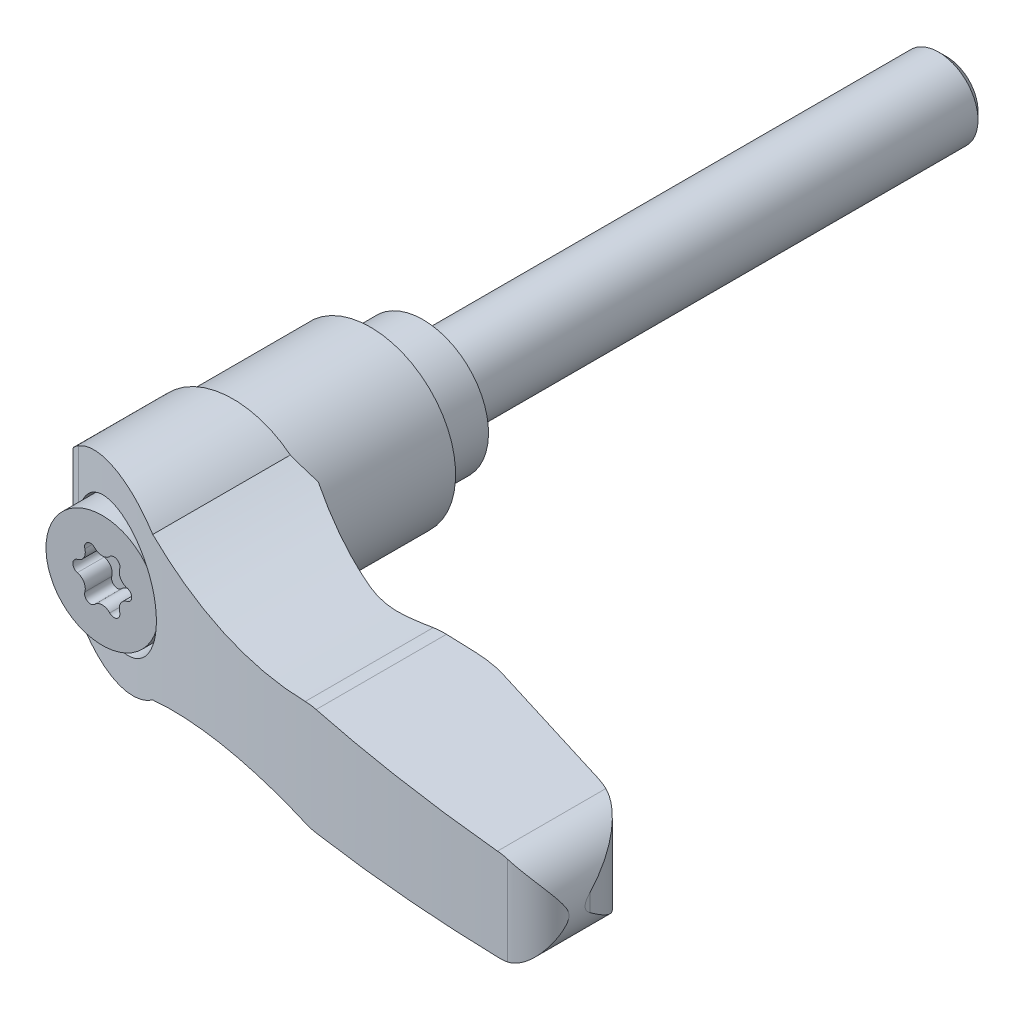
ISO-10303-21;
HEADER;
FILE_DESCRIPTION(('STEP AP214'),'2;1');
FILE_NAME('part.step','',(''),(''),'','','');
FILE_SCHEMA(('AUTOMOTIVE_DESIGN { 1 0 10303 214 1 1 1 1 }'));
ENDSEC;
DATA;
#1=APPLICATION_CONTEXT('core data for automotive mechanical design processes');
#2=APPLICATION_PROTOCOL_DEFINITION('international standard','automotive_design',2000,#1);
#3=PRODUCT_CONTEXT('',#1,'mechanical');
#4=PRODUCT('Part','Part','',(#3));
#5=PRODUCT_RELATED_PRODUCT_CATEGORY('part','',(#4));
#6=PRODUCT_DEFINITION_FORMATION('','',#4);
#7=PRODUCT_DEFINITION_CONTEXT('part definition',#1,'design');
#8=PRODUCT_DEFINITION('design','',#6,#7);
#9=PRODUCT_DEFINITION_SHAPE('','',#8);
#10=(LENGTH_UNIT() NAMED_UNIT(*) SI_UNIT(.MILLI.,.METRE.));
#11=(NAMED_UNIT(*) PLANE_ANGLE_UNIT() SI_UNIT($,.RADIAN.));
#12=(NAMED_UNIT(*) SI_UNIT($,.STERADIAN.) SOLID_ANGLE_UNIT());
#13=UNCERTAINTY_MEASURE_WITH_UNIT(LENGTH_MEASURE(1.E-05),#10,'distance_accuracy_value','');
#14=(GEOMETRIC_REPRESENTATION_CONTEXT(3) GLOBAL_UNCERTAINTY_ASSIGNED_CONTEXT((#13)) GLOBAL_UNIT_ASSIGNED_CONTEXT((#10,
#11,#12)) REPRESENTATION_CONTEXT('',''));
#15=CARTESIAN_POINT('',(0.,0.,0.));
#16=DIRECTION('',(0.,0.,1.));
#17=DIRECTION('',(1.,0.,0.));
#18=AXIS2_PLACEMENT_3D('',#15,#16,#17);
#19=CARTESIAN_POINT('',(0.,0.,-4.6928325));
#20=DIRECTION('',(0.,0.,-1.));
#21=DIRECTION('',(0.,1.,0.));
#22=AXIS2_PLACEMENT_3D('',#19,#20,#21);
#23=CYLINDRICAL_SURFACE('',#22,3.);
#24=CARTESIAN_POINT('',(0.,0.,-39.39));
#25=DIRECTION('',(0.,0.,-1.));
#26=DIRECTION('',(0.,1.,0.));
#27=AXIS2_PLACEMENT_3D('',#24,#25,#26);
#28=CIRCLE('',#27,3.);
#29=CARTESIAN_POINT('',(0.,3.,-39.39));
#30=VERTEX_POINT('',#29);
#31=EDGE_CURVE('E9',#30,#30,#28,.F.);
#32=ORIENTED_EDGE('',*,*,#31,.T.);
#33=EDGE_LOOP('',(#32));
#34=FACE_BOUND('',#33,.T.);
#35=CARTESIAN_POINT('',(0.,0.,0.));
#36=DIRECTION('',(0.,0.,-1.));
#37=DIRECTION('',(0.,1.,0.));
#38=AXIS2_PLACEMENT_3D('',#35,#36,#37);
#39=CIRCLE('',#38,3.);
#40=CARTESIAN_POINT('',(0.,3.,0.));
#41=VERTEX_POINT('',#40);
#42=EDGE_CURVE('E566',#41,#41,#39,.F.);
#43=ORIENTED_EDGE('',*,*,#42,.F.);
#44=EDGE_LOOP('',(#43));
#45=FACE_BOUND('',#44,.T.);
#46=ADVANCED_FACE('F15',(#34,#45),#23,.T.);
#47=CARTESIAN_POINT('',(4.,0.,0.));
#48=DIRECTION('',(0.,0.,-1.));
#49=DIRECTION('',(0.,1.,0.));
#50=AXIS2_PLACEMENT_3D('',#47,#48,#49);
#51=PLANE('',#50);
#52=ORIENTED_EDGE('',*,*,#42,.T.);
#53=EDGE_LOOP('',(#52));
#54=FACE_BOUND('',#53,.T.);
#55=CARTESIAN_POINT('',(0.,0.,0.));
#56=DIRECTION('',(0.,0.,-1.));
#57=DIRECTION('',(0.,1.,0.));
#58=AXIS2_PLACEMENT_3D('',#55,#56,#57);
#59=CIRCLE('',#58,5.);
#60=CARTESIAN_POINT('',(0.,5.,0.));
#61=VERTEX_POINT('',#60);
#62=EDGE_CURVE('E726',#61,#61,#59,.F.);
#63=ORIENTED_EDGE('',*,*,#62,.F.);
#64=EDGE_LOOP('',(#63));
#65=FACE_BOUND('',#64,.T.);
#66=ADVANCED_FACE('F669',(#54,#65),#51,.T.);
#67=CARTESIAN_POINT('',(0.,0.,6.4));
#68=DIRECTION('',(0.,0.,-1.));
#69=DIRECTION('',(0.,1.,0.));
#70=AXIS2_PLACEMENT_3D('',#67,#68,#69);
#71=CYLINDRICAL_SURFACE('',#70,5.);
#72=ORIENTED_EDGE('',*,*,#62,.T.);
#73=EDGE_LOOP('',(#72));
#74=FACE_BOUND('',#73,.T.);
#75=CARTESIAN_POINT('',(0.,0.,4.55000000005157));
#76=DIRECTION('',(0.,0.,-1.));
#77=DIRECTION('',(1.,0.,0.));
#78=AXIS2_PLACEMENT_3D('',#75,#76,#77);
#79=CIRCLE('',#78,4.99999999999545);
#80=CARTESIAN_POINT('',(4.99999999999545,0.,4.55000000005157));
#81=VERTEX_POINT('',#80);
#82=EDGE_CURVE('E559',#81,#81,#79,.T.);
#83=ORIENTED_EDGE('',*,*,#82,.T.);
#84=EDGE_LOOP('',(#83));
#85=FACE_BOUND('',#84,.T.);
#86=ADVANCED_FACE('F676',(#74,#85),#71,.T.);
#87=CARTESIAN_POINT('',(0.,0.,4.30000000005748));
#88=DIRECTION('',(0.,0.,-1.));
#89=DIRECTION('',(0.,1.,0.));
#90=AXIS2_PLACEMENT_3D('',#87,#88,#89);
#91=CONICAL_SURFACE('',#90,5.24999999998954,0.785398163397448);
#92=ORIENTED_EDGE('',*,*,#82,.F.);
#93=EDGE_LOOP('',(#92));
#94=FACE_BOUND('',#93,.T.);
#95=CARTESIAN_POINT('',(0.,0.,4.3));
#96=DIRECTION('',(0.,0.,-1.));
#97=DIRECTION('',(0.,1.,0.));
#98=AXIS2_PLACEMENT_3D('',#95,#96,#97);
#99=CIRCLE('',#98,5.25);
#100=CARTESIAN_POINT('',(0.,5.25,4.3));
#101=VERTEX_POINT('',#100);
#102=EDGE_CURVE('E555',#101,#101,#99,.T.);
#103=ORIENTED_EDGE('',*,*,#102,.T.);
#104=EDGE_LOOP('',(#103));
#105=FACE_BOUND('',#104,.T.);
#106=ADVANCED_FACE('F684',(#94,#105),#91,.F.);
#107=CARTESIAN_POINT('',(0.,0.,3.65));
#108=DIRECTION('',(0.,0.,-1.));
#109=DIRECTION('',(0.,1.,0.));
#110=AXIS2_PLACEMENT_3D('',#107,#108,#109);
#111=CYLINDRICAL_SURFACE('',#110,5.25);
#112=ORIENTED_EDGE('',*,*,#102,.F.);
#113=EDGE_LOOP('',(#112));
#114=FACE_BOUND('',#113,.T.);
#115=CARTESIAN_POINT('',(0.,0.,4.));
#116=DIRECTION('',(0.,0.,-1.));
#117=DIRECTION('',(0.,1.,0.));
#118=AXIS2_PLACEMENT_3D('',#115,#116,#117);
#119=CIRCLE('',#118,5.25);
#120=CARTESIAN_POINT('',(0.,5.25,4.));
#121=VERTEX_POINT('',#120);
#122=EDGE_CURVE('E714',#121,#121,#119,.F.);
#123=ORIENTED_EDGE('',*,*,#122,.F.);
#124=EDGE_LOOP('',(#123));
#125=FACE_BOUND('',#124,.T.);
#126=ADVANCED_FACE('F691',(#114,#125),#111,.F.);
#127=CARTESIAN_POINT('',(-6.36002265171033,-14.,4.));
#128=DIRECTION('',(0.707106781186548,0.,0.707106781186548));
#129=DIRECTION('',(-0.707106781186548,0.,0.707106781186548));
#130=AXIS2_PLACEMENT_3D('',#127,#128,#129);
#131=PLANE('',#130);
#132=DIRECTION('',(0.,1.,0.));
#133=VECTOR('',#132,1.);
#134=CARTESIAN_POINT('',(-6.36002265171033,0.,4.));
#135=LINE('',#134,#133);
#136=CARTESIAN_POINT('',(-6.36002265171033,-1.38824072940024,4.));
#137=VERTEX_POINT('',#136);
#138=CARTESIAN_POINT('',(-6.36002265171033,1.38824072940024,4.));
#139=VERTEX_POINT('',#138);
#140=EDGE_CURVE('E716',#137,#139,#135,.T.);
#141=ORIENTED_EDGE('',*,*,#140,.F.);
#142=CARTESIAN_POINT('',(-0.0100000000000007,0.,-2.35002265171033));
#143=DIRECTION('',(0.707106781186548,0.,0.707106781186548));
#144=DIRECTION('',(-0.707106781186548,0.,0.707106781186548));
#145=AXIS2_PLACEMENT_3D('',#142,#143,#144);
#146=ELLIPSE('',#145,9.19238815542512,6.5);
#147=EDGE_CURVE('E558',#139,#137,#146,.T.);
#148=ORIENTED_EDGE('',*,*,#147,.F.);
#149=EDGE_LOOP('',(#141,#148));
#150=FACE_BOUND('',#149,.T.);
#151=ADVANCED_FACE('F695',(#150),#131,.F.);
#152=CARTESIAN_POINT('',(-3.26,0.,4.));
#153=DIRECTION('',(0.,0.,-1.));
#154=DIRECTION('',(0.,1.,0.));
#155=AXIS2_PLACEMENT_3D('',#152,#153,#154);
#156=PLANE('',#155);
#157=CARTESIAN_POINT('',(-0.00999999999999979,0.,4.));
#158=DIRECTION('',(0.,0.,1.));
#159=DIRECTION('',(-1.,0.,0.));
#160=AXIS2_PLACEMENT_3D('',#157,#158,#159);
#161=CIRCLE('',#160,6.5);
#162=EDGE_CURVE('E710',#137,#139,#161,.T.);
#163=ORIENTED_EDGE('',*,*,#162,.F.);
#164=ORIENTED_EDGE('',*,*,#140,.T.);
#165=EDGE_LOOP('',(#163,#164));
#166=FACE_BOUND('',#165,.T.);
#167=ORIENTED_EDGE('',*,*,#122,.T.);
#168=EDGE_LOOP('',(#167));
#169=FACE_BOUND('',#168,.T.);
#170=ADVANCED_FACE('F698',(#166,#169),#156,.T.);
#171=CARTESIAN_POINT('',(39.9389658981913,-8.,27.2042491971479));
#172=DIRECTION('',(0.989626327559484,0.,-0.143665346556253));
#173=DIRECTION('',(0.143665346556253,0.,0.989626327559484));
#174=AXIS2_PLACEMENT_3D('',#171,#172,#173);
#175=PLANE('',#174);
#176=CARTESIAN_POINT('',(36.5,0.,3.51522972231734));
#177=DIRECTION('',(0.989626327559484,0.,-0.143665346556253));
#178=DIRECTION('',(0.143665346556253,0.,0.989626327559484));
#179=AXIS2_PLACEMENT_3D('',#176,#177,#178);
#180=ELLIPSE('',#179,24.3621728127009,3.5);
#181=CARTESIAN_POINT('',(39.9389658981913,-0.650779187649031,27.2042491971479));
#182=VERTEX_POINT('',#181);
#183=CARTESIAN_POINT('',(39.9389658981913,0.650779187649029,27.2042491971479));
#184=VERTEX_POINT('',#183);
#185=EDGE_CURVE('E462',#182,#184,#180,.F.);
#186=ORIENTED_EDGE('',*,*,#185,.F.);
#187=DIRECTION('',(0.,-1.,0.));
#188=VECTOR('',#187,1.);
#189=CARTESIAN_POINT('',(39.9389658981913,-8.,27.2042491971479));
#190=LINE('',#189,#188);
#191=EDGE_CURVE('E849',#184,#182,#190,.T.);
#192=ORIENTED_EDGE('',*,*,#191,.F.);
#193=EDGE_LOOP('',(#186,#192));
#194=FACE_BOUND('',#193,.T.);
#195=ADVANCED_FACE('F486',(#194),#175,.T.);
#196=CARTESIAN_POINT('',(33.8626602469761,-8.,28.0863544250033));
#197=DIRECTION('',(0.,-1.,0.));
#198=DIRECTION('',(1.,0.,0.));
#199=AXIS2_PLACEMENT_3D('',#196,#197,#198);
#200=CYLINDRICAL_SURFACE('',#199,6.14);
#201=ORIENTED_EDGE('',*,*,#191,.T.);
#202=CARTESIAN_POINT('',(36.5,-3.5,22.5416236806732));
#203=CARTESIAN_POINT('',(36.6061539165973,-3.50000941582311,22.5920863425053));
#204=CARTESIAN_POINT('',(36.7107657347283,-3.49517280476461,22.6456099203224));
#205=CARTESIAN_POINT('',(36.9160027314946,-3.47671082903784,22.758101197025));
#206=CARTESIAN_POINT('',(37.0166343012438,-3.46310021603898,22.8170596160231));
#207=CARTESIAN_POINT('',(37.2123479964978,-3.42816986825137,22.9392782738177));
#208=CARTESIAN_POINT('',(37.3074768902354,-3.40693163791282,23.002487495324));
#209=CARTESIAN_POINT('',(37.4929223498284,-3.3575759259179,23.13320682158));
#210=CARTESIAN_POINT('',(37.5832363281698,-3.32945478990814,23.2007191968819));
#211=CARTESIAN_POINT('',(37.7830795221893,-3.25850520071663,23.358740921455));
#212=CARTESIAN_POINT('',(37.8909927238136,-3.21376078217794,23.4504360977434));
#213=CARTESIAN_POINT('',(38.0982482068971,-3.11588681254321,23.6389903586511));
#214=CARTESIAN_POINT('',(38.1975840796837,-3.06275107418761,23.7358532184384));
#215=CARTESIAN_POINT('',(38.3880468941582,-2.94917464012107,23.9343090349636));
#216=CARTESIAN_POINT('',(38.4791322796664,-2.88870020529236,24.0359224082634));
#217=CARTESIAN_POINT('',(38.6526412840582,-2.76182607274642,24.2426721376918));
#218=CARTESIAN_POINT('',(38.7350674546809,-2.69542813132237,24.3478074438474));
#219=CARTESIAN_POINT('',(38.9229341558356,-2.52996933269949,24.6038856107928));
#220=CARTESIAN_POINT('',(39.0243159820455,-2.42850340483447,24.7562617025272));
#221=CARTESIAN_POINT('',(39.2111706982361,-2.21796613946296,25.0654781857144));
#222=CARTESIAN_POINT('',(39.2966363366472,-2.10889136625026,25.2223205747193));
#223=CARTESIAN_POINT('',(39.452222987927,-1.88493092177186,25.5392893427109));
#224=CARTESIAN_POINT('',(39.5223498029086,-1.77004746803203,25.699414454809));
#225=CARTESIAN_POINT('',(39.6478320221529,-1.53583460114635,26.0220530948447));
#226=CARTESIAN_POINT('',(39.7031929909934,-1.41650688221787,26.1845656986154));
#227=CARTESIAN_POINT('',(39.7933776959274,-1.1901857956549,26.4900634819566));
#228=CARTESIAN_POINT('',(39.8299343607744,-1.08360162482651,26.6328455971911));
#229=CARTESIAN_POINT('',(39.8923391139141,-0.86858691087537,26.918504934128));
#230=CARTESIAN_POINT('',(39.918226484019,-0.76016469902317,27.0613798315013));
#231=CARTESIAN_POINT('',(39.9389658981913,-0.650779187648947,27.204249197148));
#232=B_SPLINE_CURVE_WITH_KNOTS('',3,(#202,#203,#204,#205,#206,#207,#208,#209,#210,#211,#212,
#213,#214,#215,#216,#217,#218,#219,#220,#221,#222,#223,#224,#225,#226,#227,#228,#229,#230,#231),
.UNSPECIFIED.,.F.,.F.,(4,2,2,2,2,2,2,2,2,2,2,2,2,2,4),(0.,0.352350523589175,0.704110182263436,
1.05221781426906,1.40051067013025,1.84538152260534,2.29058194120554,2.73791274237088,
3.18511134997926,3.81198117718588,4.43913591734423,5.06605301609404,5.69273352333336,
6.23807905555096,6.78139842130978),.UNSPECIFIED.);
#233=CARTESIAN_POINT('',(36.5,-3.5,22.5416236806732));
#234=VERTEX_POINT('',#233);
#235=EDGE_CURVE('E466',#234,#182,#232,.T.);
#236=ORIENTED_EDGE('',*,*,#235,.F.);
#237=CARTESIAN_POINT('',(33.8626602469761,-3.59762871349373,28.0863544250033));
#238=DIRECTION('',(-0.0369925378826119,0.999315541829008,0.));
#239=DIRECTION('',(-0.999315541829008,-0.0369925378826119,0.));
#240=AXIS2_PLACEMENT_3D('',#237,#238,#239);
#241=ELLIPSE('',#240,6.14420545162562,6.14);
#242=CARTESIAN_POINT('',(35.5344609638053,-3.53574220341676,22.1783359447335));
#243=VERTEX_POINT('',#242);
#244=EDGE_CURVE('E718',#234,#243,#241,.T.);
#245=ORIENTED_EDGE('',*,*,#244,.T.);
#246=DIRECTION('',(0.,-1.,0.));
#247=VECTOR('',#246,1.);
#248=CARTESIAN_POINT('',(35.5344609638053,-8.,22.1783359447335));
#249=LINE('',#248,#247);
#250=CARTESIAN_POINT('',(35.5344609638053,3.53574220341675,22.1783359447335));
#251=VERTEX_POINT('',#250);
#252=EDGE_CURVE('E540',#251,#243,#249,.T.);
#253=ORIENTED_EDGE('',*,*,#252,.F.);
#254=CARTESIAN_POINT('',(33.8626602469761,3.59762871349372,28.0863544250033));
#255=DIRECTION('',(-0.036992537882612,-0.999315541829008,0.));
#256=DIRECTION('',(0.999315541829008,-0.036992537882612,0.));
#257=AXIS2_PLACEMENT_3D('',#254,#255,#256);
#258=ELLIPSE('',#257,6.14420545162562,6.14);
#259=CARTESIAN_POINT('',(36.5,3.5,22.5416236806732));
#260=VERTEX_POINT('',#259);
#261=EDGE_CURVE('E848',#251,#260,#258,.T.);
#262=ORIENTED_EDGE('',*,*,#261,.T.);
#263=CARTESIAN_POINT('',(39.9389658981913,0.65077918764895,27.204249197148));
#264=CARTESIAN_POINT('',(39.9247028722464,0.726086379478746,27.1059853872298));
#265=CARTESIAN_POINT('',(39.9079968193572,0.800887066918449,27.0076860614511));
#266=CARTESIAN_POINT('',(39.8696347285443,0.949458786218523,26.8112602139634));
#267=CARTESIAN_POINT('',(39.8479781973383,1.02322971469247,26.7131337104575));
#268=CARTESIAN_POINT('',(39.7995979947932,1.169880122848,26.5170899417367));
#269=CARTESIAN_POINT('',(39.7728626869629,1.24275713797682,26.4191736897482));
#270=CARTESIAN_POINT('',(39.7142815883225,1.38725410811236,26.2239599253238));
#271=CARTESIAN_POINT('',(39.6824358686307,1.4588740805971,26.1266624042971));
#272=CARTESIAN_POINT('',(39.5782917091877,1.67318502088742,25.8337016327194));
#273=CARTESIAN_POINT('',(39.4979263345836,1.81366367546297,25.6391889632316));
#274=CARTESIAN_POINT('',(39.3150854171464,2.08619457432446,25.2551202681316));
#275=CARTESIAN_POINT('',(39.2126344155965,2.218255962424,25.0655590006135));
#276=CARTESIAN_POINT('',(38.9595027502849,2.49877334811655,24.6523338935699));
#277=CARTESIAN_POINT('',(38.8031801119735,2.64456339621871,24.4302018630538));
#278=CARTESIAN_POINT('',(38.5417124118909,2.84488994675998,24.1082756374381));
#279=CARTESIAN_POINT('',(38.4501831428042,2.90854134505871,24.0029632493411));
#280=CARTESIAN_POINT('',(38.2579442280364,3.02861213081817,23.7967186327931));
#281=CARTESIAN_POINT('',(38.1572360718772,3.08503268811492,23.6957856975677));
#282=CARTESIAN_POINT('',(37.8892625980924,3.21757634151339,23.4457323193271));
#283=CARTESIAN_POINT('',(37.7155213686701,3.28779061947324,23.3001643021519));
#284=CARTESIAN_POINT('',(37.4396992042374,3.37286339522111,23.0946053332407));
#285=CARTESIAN_POINT('',(37.3453175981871,3.39783246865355,23.0282732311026));
#286=CARTESIAN_POINT('',(37.1517842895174,3.44019984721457,22.9003457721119));
#287=CARTESIAN_POINT('',(37.0526354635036,3.45760265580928,22.8387476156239));
#288=CARTESIAN_POINT('',(36.8781783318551,3.48029211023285,22.7372021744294));
#289=CARTESIAN_POINT('',(36.8038676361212,3.48759914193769,22.6959814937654));
#290=CARTESIAN_POINT('',(36.6533047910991,3.497455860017,22.6165121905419));
#291=CARTESIAN_POINT('',(36.5770513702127,3.50000234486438,22.5782655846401));
#292=CARTESIAN_POINT('',(36.5,3.5,22.5416236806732));
#293=B_SPLINE_CURVE_WITH_KNOTS('',3,(#263,#264,#265,#266,#267,#268,#269,#270,#271,#272,#273,
#274,#275,#276,#277,#278,#279,#280,#281,#282,#283,#284,#285,#286,#287,#288,#289,#290,#291,#292),
.UNSPECIFIED.,.F.,.F.,(4,2,2,2,2,2,2,2,2,2,2,2,2,2,4),(0.,0.373839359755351,0.747715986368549,
1.12245980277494,1.49719840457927,2.25512351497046,3.01221072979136,3.93367725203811,
4.39332639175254,4.85290107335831,5.56171222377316,5.91546495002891,6.26900683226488,
6.52468766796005,6.78054039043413),.UNSPECIFIED.);
#294=EDGE_CURVE('E435',#184,#260,#293,.T.);
#295=ORIENTED_EDGE('',*,*,#294,.F.);
#296=EDGE_LOOP('',(#201,#236,#245,#253,#262,#295));
#297=FACE_BOUND('',#296,.T.);
#298=ADVANCED_FACE('F480',(#297),#200,.T.);
#299=CARTESIAN_POINT('',(-0.0099999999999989,0.,10.28125));
#300=DIRECTION('',(0.,0.,1.));
#301=DIRECTION('',(-1.,0.,0.));
#302=AXIS2_PLACEMENT_3D('',#299,#300,#301);
#303=CYLINDRICAL_SURFACE('',#302,6.5);
#304=CARTESIAN_POINT('',(-0.00999999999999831,0.,14.5));
#305=DIRECTION('',(0.,0.,1.));
#306=DIRECTION('',(-1.,0.,0.));
#307=AXIS2_PLACEMENT_3D('',#304,#305,#306);
#308=CIRCLE('',#307,6.5);
#309=CARTESIAN_POINT('',(-6.51,0.,14.5));
#310=VERTEX_POINT('',#309);
#311=CARTESIAN_POINT('',(6.49,0.,14.5));
#312=VERTEX_POINT('',#311);
#313=EDGE_CURVE('E851',#310,#312,#308,.T.);
#314=ORIENTED_EDGE('',*,*,#313,.F.);
#315=CARTESIAN_POINT('',(-0.00999999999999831,0.,14.5));
#316=DIRECTION('',(0.,0.,1.));
#317=DIRECTION('',(-1.,0.,0.));
#318=AXIS2_PLACEMENT_3D('',#315,#316,#317);
#319=CIRCLE('',#318,6.5);
#320=EDGE_CURVE('E537',#312,#310,#319,.T.);
#321=ORIENTED_EDGE('',*,*,#320,.F.);
#322=EDGE_LOOP('',(#314,#321));
#323=FACE_BOUND('',#322,.T.);
#324=ORIENTED_EDGE('',*,*,#162,.T.);
#325=ORIENTED_EDGE('',*,*,#147,.T.);
#326=EDGE_LOOP('',(#324,#325));
#327=FACE_BOUND('',#326,.T.);
#328=ADVANCED_FACE('F485',(#323,#327),#303,.T.);
#329=CARTESIAN_POINT('',(-6.51,-8.,14.5));
#330=DIRECTION('',(0.,0.,-1.));
#331=DIRECTION('',(0.,1.,0.));
#332=AXIS2_PLACEMENT_3D('',#329,#330,#331);
#333=PLANE('',#332);
#334=ORIENTED_EDGE('',*,*,#313,.T.);
#335=DIRECTION('',(0.,-1.,0.));
#336=VECTOR('',#335,1.);
#337=CARTESIAN_POINT('',(6.49,-8.,14.5));
#338=LINE('',#337,#336);
#339=CARTESIAN_POINT('',(6.49,-4.77390244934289,14.5));
#340=VERTEX_POINT('',#339);
#341=EDGE_CURVE('E854',#312,#340,#338,.T.);
#342=ORIENTED_EDGE('',*,*,#341,.T.);
#343=CARTESIAN_POINT('',(14.8,-33.6,14.5));
#344=DIRECTION('',(0.,0.,1.));
#345=DIRECTION('',(0.,-1.,0.));
#346=AXIS2_PLACEMENT_3D('',#343,#344,#345);
#347=CIRCLE('',#346,30.);
#348=CARTESIAN_POINT('',(4.36278582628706,-5.47413005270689,14.5));
#349=VERTEX_POINT('',#348);
#350=EDGE_CURVE('E811',#340,#349,#347,.T.);
#351=ORIENTED_EDGE('',*,*,#350,.T.);
#352=CARTESIAN_POINT('',(0.,0.,14.5));
#353=DIRECTION('',(0.,0.,1.));
#354=DIRECTION('',(0.,-1.,0.));
#355=AXIS2_PLACEMENT_3D('',#352,#353,#354);
#356=CIRCLE('',#355,7.);
#357=CARTESIAN_POINT('',(-6.51,-2.57291663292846,14.5));
#358=VERTEX_POINT('',#357);
#359=EDGE_CURVE('E373',#358,#349,#356,.T.);
#360=ORIENTED_EDGE('',*,*,#359,.F.);
#361=DIRECTION('',(0.,-1.,0.));
#362=VECTOR('',#361,1.);
#363=CARTESIAN_POINT('',(-6.51,-8.,14.5));
#364=LINE('',#363,#362);
#365=EDGE_CURVE('E536',#310,#358,#364,.T.);
#366=ORIENTED_EDGE('',*,*,#365,.F.);
#367=EDGE_LOOP('',(#334,#342,#351,#360,#366));
#368=FACE_BOUND('',#367,.T.);
#369=ADVANCED_FACE('F491',(#368),#333,.T.);
#370=CARTESIAN_POINT('',(20.6060580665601,0.915064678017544,31.));
#371=DIRECTION('',(0.,0.,1.));
#372=DIRECTION('',(0.,-1.,0.));
#373=AXIS2_PLACEMENT_3D('',#370,#371,#372);
#374=CYLINDRICAL_SURFACE('',#373,5.);
#375=CARTESIAN_POINT('',(20.7910207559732,-4.08151303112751,28.9575923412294));
#376=CARTESIAN_POINT('',(20.6207575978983,-4.08776311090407,28.9275070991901));
#377=CARTESIAN_POINT('',(20.4510927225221,-4.08540030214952,28.8972050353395));
#378=CARTESIAN_POINT('',(20.1129595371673,-4.06344890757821,28.8361672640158));
#379=CARTESIAN_POINT('',(19.9444912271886,-4.04386032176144,28.8054315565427));
#380=CARTESIAN_POINT('',(19.7766211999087,-4.01565884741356,28.7744790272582));
#381=B_SPLINE_CURVE_WITH_KNOTS('',3,(#375,#376,#377,#378,#379,#380),.UNSPECIFIED.,.F.,.F.,(4,2,
4),(0.,0.517097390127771,1.03419478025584),.UNSPECIFIED.);
#382=CARTESIAN_POINT('',(20.7910207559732,-4.08151303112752,28.9575923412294));
#383=VERTEX_POINT('',#382);
#384=CARTESIAN_POINT('',(19.7766211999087,-4.01565884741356,28.7744790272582));
#385=VERTEX_POINT('',#384);
#386=EDGE_CURVE('E469',#383,#385,#381,.T.);
#387=ORIENTED_EDGE('',*,*,#386,.T.);
#388=DIRECTION('',(0.,0.,1.));
#389=VECTOR('',#388,1.);
#390=CARTESIAN_POINT('',(19.7766211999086,-4.01565884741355,31.));
#391=LINE('',#390,#389);
#392=CARTESIAN_POINT('',(19.7766211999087,-4.01565884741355,19.));
#393=VERTEX_POINT('',#392);
#394=EDGE_CURVE('E804',#385,#393,#391,.F.);
#395=ORIENTED_EDGE('',*,*,#394,.T.);
#396=CARTESIAN_POINT('',(20.6060580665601,0.915064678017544,19.));
#397=DIRECTION('',(0.,0.,1.));
#398=DIRECTION('',(0.,-1.,0.));
#399=AXIS2_PLACEMENT_3D('',#396,#397,#398);
#400=CIRCLE('',#399,5.);
#401=CARTESIAN_POINT('',(20.7910207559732,-4.08151303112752,19.));
#402=VERTEX_POINT('',#401);
#403=EDGE_CURVE('E858',#402,#393,#400,.F.);
#404=ORIENTED_EDGE('',*,*,#403,.F.);
#405=DIRECTION('',(0.,0.,1.));
#406=VECTOR('',#405,1.);
#407=CARTESIAN_POINT('',(20.7910207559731,-4.08151303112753,31.));
#408=LINE('',#407,#406);
#409=EDGE_CURVE('E810',#402,#383,#408,.T.);
#410=ORIENTED_EDGE('',*,*,#409,.T.);
#411=EDGE_LOOP('',(#387,#395,#404,#410));
#412=FACE_BOUND('',#411,.T.);
#413=ADVANCED_FACE('F427',(#412),#374,.T.);
#414=CARTESIAN_POINT('',(36.5,0.,31.));
#415=DIRECTION('',(0.,0.,1.));
#416=DIRECTION('',(0.,-1.,0.));
#417=AXIS2_PLACEMENT_3D('',#414,#415,#416);
#418=CYLINDRICAL_SURFACE('',#417,3.5);
#419=CARTESIAN_POINT('',(37.3240183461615,-3.40161634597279,30.8631619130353));
#420=CARTESIAN_POINT('',(37.188603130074,-3.43435641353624,30.8557619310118));
#421=CARTESIAN_POINT('',(37.0522273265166,-3.45892508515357,30.8481012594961));
#422=CARTESIAN_POINT('',(36.7775545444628,-3.49171963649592,30.8322585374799));
#423=CARTESIAN_POINT('',(36.6392575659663,-3.499945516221,30.8240764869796));
#424=CARTESIAN_POINT('',(36.5,-3.5,30.815633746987));
#425=B_SPLINE_CURVE_WITH_KNOTS('',3,(#419,#420,#421,#422,#423,#424),.UNSPECIFIED.,.F.,.F.,(4,2,
4),(0.,0.416348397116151,0.832696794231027),.UNSPECIFIED.);
#426=CARTESIAN_POINT('',(37.3240183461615,-3.40161634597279,30.8631619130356));
#427=VERTEX_POINT('',#426);
#428=CARTESIAN_POINT('',(36.5,-3.5,30.815633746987));
#429=VERTEX_POINT('',#428);
#430=EDGE_CURVE('E447',#427,#429,#425,.T.);
#431=ORIENTED_EDGE('',*,*,#430,.T.);
#432=DIRECTION('',(0.,0.,1.));
#433=VECTOR('',#432,1.);
#434=CARTESIAN_POINT('',(36.5,-3.5,31.));
#435=LINE('',#434,#433);
#436=EDGE_CURVE('E821',#429,#234,#435,.F.);
#437=ORIENTED_EDGE('',*,*,#436,.T.);
#438=ORIENTED_EDGE('',*,*,#235,.T.);
#439=ORIENTED_EDGE('',*,*,#185,.T.);
#440=ORIENTED_EDGE('',*,*,#294,.T.);
#441=DIRECTION('',(0.,0.,1.));
#442=VECTOR('',#441,1.);
#443=CARTESIAN_POINT('',(36.5,3.5,31.));
#444=LINE('',#443,#442);
#445=CARTESIAN_POINT('',(36.5,3.5,30.815633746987));
#446=VERTEX_POINT('',#445);
#447=EDGE_CURVE('E415',#260,#446,#444,.T.);
#448=ORIENTED_EDGE('',*,*,#447,.T.);
#449=CARTESIAN_POINT('',(36.5,3.5,30.815633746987));
#450=CARTESIAN_POINT('',(36.6392575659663,3.499945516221,30.8240764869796));
#451=CARTESIAN_POINT('',(36.7775545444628,3.49171963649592,30.8322585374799));
#452=CARTESIAN_POINT('',(37.0522273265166,3.45892508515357,30.8481012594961));
#453=CARTESIAN_POINT('',(37.188603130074,3.43435641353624,30.8557619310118));
#454=CARTESIAN_POINT('',(37.3240183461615,3.40161634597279,30.8631619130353));
#455=B_SPLINE_CURVE_WITH_KNOTS('',3,(#449,#450,#451,#452,#453,#454),.UNSPECIFIED.,.F.,.F.,(4,2,
4),(0.,0.416348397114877,0.832696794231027),.UNSPECIFIED.);
#456=CARTESIAN_POINT('',(37.3240183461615,3.40161634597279,30.8631619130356));
#457=VERTEX_POINT('',#456);
#458=EDGE_CURVE('E453',#446,#457,#455,.T.);
#459=ORIENTED_EDGE('',*,*,#458,.T.);
#460=CARTESIAN_POINT('',(37.3240183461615,-3.40161634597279,30.8631619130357));
#461=CARTESIAN_POINT('',(37.391971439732,-3.38517327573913,30.8668921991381));
#462=CARTESIAN_POINT('',(37.4595366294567,-3.36663320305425,30.8678982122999));
#463=CARTESIAN_POINT('',(37.5932555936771,-3.32560440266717,30.8647814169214));
#464=CARTESIAN_POINT('',(37.6594109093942,-3.30312026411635,30.8606645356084));
#465=CARTESIAN_POINT('',(37.7892420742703,-3.25463078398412,30.8476880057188));
#466=CARTESIAN_POINT('',(37.8529349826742,-3.22865926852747,30.8388717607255));
#467=CARTESIAN_POINT('',(37.9780608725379,-3.17332967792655,30.8169101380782));
#468=CARTESIAN_POINT('',(38.0394932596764,-3.14397072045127,30.8037636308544));
#469=CARTESIAN_POINT('',(38.2193405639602,-3.05154774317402,30.7585650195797));
#470=CARTESIAN_POINT('',(38.3339861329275,-2.98387991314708,30.7206782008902));
#471=CARTESIAN_POINT('',(38.5517467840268,-2.83858348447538,30.6324207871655));
#472=CARTESIAN_POINT('',(38.6548343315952,-2.76093200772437,30.5820212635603));
#473=CARTESIAN_POINT('',(38.8266237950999,-2.61655584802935,30.4842690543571));
#474=CARTESIAN_POINT('',(38.8977926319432,-2.55140368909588,30.4388637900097));
#475=CARTESIAN_POINT('',(39.0330318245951,-2.41719472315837,30.3433991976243));
#476=CARTESIAN_POINT('',(39.0970985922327,-2.34813596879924,30.2933375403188));
#477=CARTESIAN_POINT('',(39.2184581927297,-2.20651617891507,30.1893556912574));
#478=CARTESIAN_POINT('',(39.2757265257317,-2.13394372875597,30.1354226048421));
#479=CARTESIAN_POINT('',(39.3834200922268,-1.9860149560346,30.0247265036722));
#480=CARTESIAN_POINT('',(39.4338475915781,-1.91065956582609,29.9679644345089));
#481=CARTESIAN_POINT('',(39.542421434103,-1.73419420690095,29.8348143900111));
#482=CARTESIAN_POINT('',(39.598263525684,-1.63221056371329,29.7576996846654));
#483=CARTESIAN_POINT('',(39.699250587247,-1.42414609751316,29.601672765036));
#484=CARTESIAN_POINT('',(39.7443776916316,-1.31805876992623,29.5227577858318));
#485=CARTESIAN_POINT('',(39.8239747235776,-1.10201279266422,29.3659397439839));
#486=CARTESIAN_POINT('',(39.8584944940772,-0.992075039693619,29.2880336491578));
#487=CARTESIAN_POINT('',(39.9024720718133,-0.82253324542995,29.1754655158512));
#488=CARTESIAN_POINT('',(39.9158188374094,-0.765322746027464,29.13870216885));
#489=CARTESIAN_POINT('',(39.9398686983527,-0.648731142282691,29.0678855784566));
#490=CARTESIAN_POINT('',(39.9505741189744,-0.589352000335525,29.0338299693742));
#491=CARTESIAN_POINT('',(39.9677206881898,-0.477086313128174,28.9756719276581));
#492=CARTESIAN_POINT('',(39.974567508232,-0.424644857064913,28.9508463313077));
#493=CARTESIAN_POINT('',(39.9860225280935,-0.317100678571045,28.907341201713));
#494=CARTESIAN_POINT('',(39.9906385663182,-0.262008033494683,28.8886402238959));
#495=CARTESIAN_POINT('',(39.9966232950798,-0.160247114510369,28.8637621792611));
#496=CARTESIAN_POINT('',(39.9984523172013,-0.114054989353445,28.8558445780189));
#497=CARTESIAN_POINT('',(40.0002450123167,-0.0209847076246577,28.8480882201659));
#498=CARTESIAN_POINT('',(40.0002117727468,0.0258921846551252,28.8482360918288));
#499=CARTESIAN_POINT('',(39.9982952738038,0.118672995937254,28.8565205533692));
#500=CARTESIAN_POINT('',(39.9964185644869,0.164579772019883,28.8646288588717));
#501=CARTESIAN_POINT('',(39.9910078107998,0.254792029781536,28.8870889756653));
#502=CARTESIAN_POINT('',(39.9874686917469,0.299092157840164,28.9014598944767));
#503=CARTESIAN_POINT('',(39.9768286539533,0.407331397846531,28.9425912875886));
#504=CARTESIAN_POINT('',(39.9688318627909,0.470155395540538,28.9719647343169));
#505=CARTESIAN_POINT('',(39.9499914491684,0.592804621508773,29.0357410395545));
#506=CARTESIAN_POINT('',(39.9391403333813,0.652621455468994,29.0701570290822));
#507=CARTESIAN_POINT('',(39.9146680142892,0.770512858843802,29.1419527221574));
#508=CARTESIAN_POINT('',(39.9010255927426,0.828569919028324,29.1793537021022));
#509=CARTESIAN_POINT('',(39.8711029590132,0.942947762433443,29.2555520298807));
#510=CARTESIAN_POINT('',(39.8548256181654,0.999270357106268,29.2943478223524));
#511=CARTESIAN_POINT('',(39.8016739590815,1.1674299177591,29.4125134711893));
#512=CARTESIAN_POINT('',(39.7607265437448,1.27728939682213,29.4929030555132));
#513=CARTESIAN_POINT('',(39.6677865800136,1.49294867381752,29.6529500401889));
#514=CARTESIAN_POINT('',(39.6157834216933,1.59874445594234,29.7326066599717));
#515=CARTESIAN_POINT('',(39.5005966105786,1.80564912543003,29.8886982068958));
#516=CARTESIAN_POINT('',(39.4374685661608,1.90677830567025,29.9651469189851));
#517=CARTESIAN_POINT('',(39.2994325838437,2.10420227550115,30.1133265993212));
#518=CARTESIAN_POINT('',(39.2245348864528,2.20050117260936,30.1850615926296));
#519=CARTESIAN_POINT('',(39.0442952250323,2.40820732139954,30.3372677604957));
#520=CARTESIAN_POINT('',(38.9358891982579,2.51819093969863,30.4161164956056));
#521=CARTESIAN_POINT('',(38.7000552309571,2.72661786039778,30.559662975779));
#522=CARTESIAN_POINT('',(38.5726400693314,2.82506883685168,30.6243701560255));
#523=CARTESIAN_POINT('',(38.3254291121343,2.98922527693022,30.7237895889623));
#524=CARTESIAN_POINT('',(38.2087731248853,3.05759969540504,30.7618633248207));
#525=CARTESIAN_POINT('',(37.9650872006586,3.18151973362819,30.8217517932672));
#526=CARTESIAN_POINT('',(37.8380870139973,3.23710049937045,30.8436114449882));
#527=CARTESIAN_POINT('',(37.6449762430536,3.3080955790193,30.8616374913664));
#528=CARTESIAN_POINT('',(37.5816159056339,3.32934954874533,30.8652564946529));
#529=CARTESIAN_POINT('',(37.4536360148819,3.36824327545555,30.867801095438));
#530=CARTESIAN_POINT('',(37.389015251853,3.38587935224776,30.8667219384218));
#531=CARTESIAN_POINT('',(37.3240183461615,3.40161634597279,30.8631619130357));
#532=B_SPLINE_CURVE_WITH_KNOTS('',3,(#460,#461,#462,#463,#464,#465,#466,#467,#468,#469,#470,
#471,#472,#473,#474,#475,#476,#477,#478,#479,#480,#481,#482,#483,#484,#485,#486,#487,#488,#489,
#490,#491,#492,#493,#494,#495,#496,#497,#498,#499,#500,#501,#502,#503,#504,#505,#506,#507,#508,
#509,#510,#511,#512,#513,#514,#515,#516,#517,#518,#519,#520,#521,#522,#523,#524,#525,#526,#527,
#528,#529,#530,#531),.UNSPECIFIED.,.F.,.F.,(4,2,2,2,2,2,2,2,2,2,2,2,2,2,2,2,2,2,2,2,2,2,2,2,2,2,
2,2,2,2,2,2,2,2,2,4),(0.,0.20991378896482,0.419584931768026,0.62735226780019,0.83517384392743,
1.2486492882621,1.66308971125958,1.98257890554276,2.30222878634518,2.62299771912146,
2.94366014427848,3.36167065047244,3.78037330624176,4.19707731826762,4.40489951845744,
4.61253810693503,4.78756393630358,4.9619702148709,5.10204921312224,5.24189598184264,
5.38124764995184,5.52102749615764,5.72989301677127,5.9393124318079,6.15038720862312,
6.36123350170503,6.7871576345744,7.21349237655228,7.63775356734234,8.06164764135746,
8.58013018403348,9.09826573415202,9.51811060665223,9.9367879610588,10.1373304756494,
10.3380759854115),.UNSPECIFIED.);
#533=EDGE_CURVE('E407',#427,#457,#532,.T.);
#534=ORIENTED_EDGE('',*,*,#533,.F.);
#535=EDGE_LOOP('',(#431,#437,#438,#439,#440,#448,#459,#534));
#536=FACE_BOUND('',#535,.T.);
#537=ADVANCED_FACE('F421',(#536),#418,.T.);
#538=CARTESIAN_POINT('',(23.0466685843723,-8.,28.05));
#539=DIRECTION('',(0.,-1.,0.));
#540=DIRECTION('',(1.,0.,0.));
#541=AXIS2_PLACEMENT_3D('',#538,#539,#540);
#542=CYLINDRICAL_SURFACE('',#541,9.05000000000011);
#543=CARTESIAN_POINT('',(23.0466685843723,3.99801374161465,28.05));
#544=DIRECTION('',(-0.036992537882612,-0.999315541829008,0.));
#545=DIRECTION('',(0.999315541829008,-0.036992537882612,0.));
#546=AXIS2_PLACEMENT_3D('',#543,#544,#545);
#547=ELLIPSE('',#546,9.05619858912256,9.05000000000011);
#548=CARTESIAN_POINT('',(23.0466685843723,3.99801374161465,19.));
#549=VERTEX_POINT('',#548);
#550=CARTESIAN_POINT('',(25.5108048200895,3.90679665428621,19.34192715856));
#551=VERTEX_POINT('',#550);
#552=EDGE_CURVE('E403',#549,#551,#547,.T.);
#553=ORIENTED_EDGE('',*,*,#552,.T.);
#554=DIRECTION('',(0.,-1.,0.));
#555=VECTOR('',#554,1.);
#556=CARTESIAN_POINT('',(25.5108048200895,-8.,19.34192715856));
#557=LINE('',#556,#555);
#558=CARTESIAN_POINT('',(25.5108048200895,-3.90679665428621,19.34192715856));
#559=VERTEX_POINT('',#558);
#560=EDGE_CURVE('E460',#559,#551,#557,.F.);
#561=ORIENTED_EDGE('',*,*,#560,.F.);
#562=CARTESIAN_POINT('',(23.0466685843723,-3.99801374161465,28.05));
#563=DIRECTION('',(-0.0369925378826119,0.999315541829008,0.));
#564=DIRECTION('',(-0.999315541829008,-0.0369925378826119,0.));
#565=AXIS2_PLACEMENT_3D('',#562,#563,#564);
#566=ELLIPSE('',#565,9.05619858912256,9.05000000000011);
#567=CARTESIAN_POINT('',(23.0466685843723,-3.99801374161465,19.));
#568=VERTEX_POINT('',#567);
#569=EDGE_CURVE('E417',#559,#568,#566,.T.);
#570=ORIENTED_EDGE('',*,*,#569,.T.);
#571=DIRECTION('',(0.,1.,0.));
#572=VECTOR('',#571,1.);
#573=CARTESIAN_POINT('',(23.0466685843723,-8.,19.));
#574=LINE('',#573,#572);
#575=EDGE_CURVE('E544',#549,#568,#574,.F.);
#576=ORIENTED_EDGE('',*,*,#575,.F.);
#577=EDGE_LOOP('',(#553,#561,#570,#576));
#578=FACE_BOUND('',#577,.T.);
#579=ADVANCED_FACE('F426',(#578),#542,.T.);
#580=CARTESIAN_POINT('',(25.5108048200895,-8.,19.34192715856));
#581=DIRECTION('',(0.272280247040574,0.,-0.962217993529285));
#582=DIRECTION('',(0.962217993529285,0.,0.272280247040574));
#583=AXIS2_PLACEMENT_3D('',#580,#581,#582);
#584=PLANE('',#583);
#585=DIRECTION('',(0.961608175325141,-0.0355966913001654,0.272107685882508));
#586=VECTOR('',#585,1.);
#587=CARTESIAN_POINT('',(25.5108048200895,3.90679665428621,19.34192715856));
#588=LINE('',#587,#586);
#589=EDGE_CURVE('E405',#551,#251,#588,.T.);
#590=ORIENTED_EDGE('',*,*,#589,.T.);
#591=ORIENTED_EDGE('',*,*,#252,.T.);
#592=DIRECTION('',(-0.961608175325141,-0.0355966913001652,-0.272107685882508));
#593=VECTOR('',#592,1.);
#594=CARTESIAN_POINT('',(35.5344609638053,-3.53574220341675,22.1783359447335));
#595=LINE('',#594,#593);
#596=EDGE_CURVE('E818',#243,#559,#595,.T.);
#597=ORIENTED_EDGE('',*,*,#596,.T.);
#598=ORIENTED_EDGE('',*,*,#560,.T.);
#599=EDGE_LOOP('',(#590,#591,#597,#598));
#600=FACE_BOUND('',#599,.T.);
#601=ADVANCED_FACE('F876',(#600),#584,.T.);
#602=CARTESIAN_POINT('',(20.60605806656,-0.915064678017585,31.));
#603=DIRECTION('',(0.,0.,1.));
#604=DIRECTION('',(0.,-1.,0.));
#605=AXIS2_PLACEMENT_3D('',#602,#603,#604);
#606=CYLINDRICAL_SURFACE('',#605,5.00000000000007);
#607=CARTESIAN_POINT('',(19.7766211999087,4.01565884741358,28.7744790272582));
#608=CARTESIAN_POINT('',(19.9444912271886,4.04386032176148,28.8054315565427));
#609=CARTESIAN_POINT('',(20.1129595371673,4.06344890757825,28.8361672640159));
#610=CARTESIAN_POINT('',(20.4510927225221,4.08540030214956,28.8972050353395));
#611=CARTESIAN_POINT('',(20.6207575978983,4.08776311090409,28.9275070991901));
#612=CARTESIAN_POINT('',(20.7910207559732,4.08151303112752,28.9575923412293));
#613=B_SPLINE_CURVE_WITH_KNOTS('',3,(#607,#608,#609,#610,#611,#612),.UNSPECIFIED.,.F.,.F.,(4,2,
4),(0.,0.517097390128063,1.03419478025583),.UNSPECIFIED.);
#614=CARTESIAN_POINT('',(19.7766211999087,4.01565884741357,28.7744790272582));
#615=VERTEX_POINT('',#614);
#616=CARTESIAN_POINT('',(20.7910207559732,4.08151303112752,28.9575923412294));
#617=VERTEX_POINT('',#616);
#618=EDGE_CURVE('E543',#615,#617,#613,.T.);
#619=ORIENTED_EDGE('',*,*,#618,.T.);
#620=DIRECTION('',(0.,0.,1.));
#621=VECTOR('',#620,1.);
#622=CARTESIAN_POINT('',(20.7910207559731,4.08151303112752,31.));
#623=LINE('',#622,#621);
#624=CARTESIAN_POINT('',(20.7910207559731,4.08151303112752,19.));
#625=VERTEX_POINT('',#624);
#626=EDGE_CURVE('E829',#617,#625,#623,.F.);
#627=ORIENTED_EDGE('',*,*,#626,.T.);
#628=CARTESIAN_POINT('',(20.60605806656,-0.915064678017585,19.));
#629=DIRECTION('',(0.,0.,1.));
#630=DIRECTION('',(0.,-1.,0.));
#631=AXIS2_PLACEMENT_3D('',#628,#629,#630);
#632=CIRCLE('',#631,5.00000000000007);
#633=CARTESIAN_POINT('',(19.7766211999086,4.01565884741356,19.));
#634=VERTEX_POINT('',#633);
#635=EDGE_CURVE('E548',#634,#625,#632,.F.);
#636=ORIENTED_EDGE('',*,*,#635,.F.);
#637=DIRECTION('',(0.,0.,1.));
#638=VECTOR('',#637,1.);
#639=CARTESIAN_POINT('',(19.7766211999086,4.01565884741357,31.));
#640=LINE('',#639,#638);
#641=EDGE_CURVE('E402',#634,#615,#640,.T.);
#642=ORIENTED_EDGE('',*,*,#641,.T.);
#643=EDGE_LOOP('',(#619,#627,#636,#642));
#644=FACE_BOUND('',#643,.T.);
#645=ADVANCED_FACE('F873',(#644),#606,.T.);
#646=CARTESIAN_POINT('',(42.8289340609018,-8.,-49.9630271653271));
#647=DIRECTION('',(0.,-1.,0.));
#648=DIRECTION('',(1.,0.,0.));
#649=AXIS2_PLACEMENT_3D('',#646,#647,#648);
#650=CYLINDRICAL_SURFACE('',#649,74.0000000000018);
#651=DIRECTION('',(0.,-1.,0.));
#652=VECTOR('',#651,1.);
#653=CARTESIAN_POINT('',(14.2560355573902,-8.,18.2981585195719));
#654=LINE('',#653,#652);
#655=CARTESIAN_POINT('',(14.2560355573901,3.60493202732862,18.2981585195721));
#656=VERTEX_POINT('',#655);
#657=CARTESIAN_POINT('',(14.2560355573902,-3.60493202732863,18.2981585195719));
#658=VERTEX_POINT('',#657);
#659=EDGE_CURVE('E856',#656,#658,#654,.T.);
#660=ORIENTED_EDGE('',*,*,#659,.T.);
#661=CARTESIAN_POINT('',(14.2560355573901,-3.60493202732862,18.2981585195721));
#662=CARTESIAN_POINT('',(13.91912090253,-3.61104217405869,18.1571345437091));
#663=CARTESIAN_POINT('',(13.5833701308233,-3.62280963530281,18.0136612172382));
#664=CARTESIAN_POINT('',(12.9145226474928,-3.65743626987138,17.7219861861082));
#665=CARTESIAN_POINT('',(12.5814258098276,-3.68029491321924,17.5737847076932));
#666=CARTESIAN_POINT('',(11.5893580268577,-3.7649360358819,17.1235938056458));
#667=CARTESIAN_POINT('',(10.9347595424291,-3.84283944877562,16.8148240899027));
#668=CARTESIAN_POINT('',(9.64003521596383,-4.03983028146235,16.1808788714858));
#669=CARTESIAN_POINT('',(8.99990836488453,-4.15891482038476,15.8557045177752));
#670=CARTESIAN_POINT('',(7.73340291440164,-4.43691869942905,15.1892512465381));
#671=CARTESIAN_POINT('',(7.10709183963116,-4.5960001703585,14.8479114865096));
#672=CARTESIAN_POINT('',(6.49,-4.77390244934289,14.5));
#673=B_SPLINE_CURVE_WITH_KNOTS('',3,(#661,#662,#663,#664,#665,#666,#667,#668,#669,#670,#671,
#672),.UNSPECIFIED.,.F.,.F.,(4,2,2,2,2,4),(0.,1.09575278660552,2.19145321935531,
4.37360080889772,6.55559577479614,8.74658240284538),.UNSPECIFIED.);
#674=EDGE_CURVE('E357',#658,#340,#673,.T.);
#675=ORIENTED_EDGE('',*,*,#674,.T.);
#676=ORIENTED_EDGE('',*,*,#341,.F.);
#677=DIRECTION('',(0.,1.,0.));
#678=VECTOR('',#677,1.);
#679=CARTESIAN_POINT('',(6.49,-8.,14.5));
#680=LINE('',#679,#678);
#681=CARTESIAN_POINT('',(6.49,4.77390244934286,14.5));
#682=VERTEX_POINT('',#681);
#683=EDGE_CURVE('E547',#682,#312,#680,.F.);
#684=ORIENTED_EDGE('',*,*,#683,.F.);
#685=CARTESIAN_POINT('',(6.49,4.77390244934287,14.5));
#686=CARTESIAN_POINT('',(7.10709183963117,4.59600017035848,14.8479114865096));
#687=CARTESIAN_POINT('',(7.73340291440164,4.43691869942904,15.1892512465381));
#688=CARTESIAN_POINT('',(8.99990836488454,4.15891482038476,15.8557045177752));
#689=CARTESIAN_POINT('',(9.64003521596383,4.03983028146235,16.1808788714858));
#690=CARTESIAN_POINT('',(10.9347595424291,3.84283944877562,16.8148240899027));
#691=CARTESIAN_POINT('',(11.5893580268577,3.7649360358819,17.1235938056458));
#692=CARTESIAN_POINT('',(12.5814258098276,3.68029491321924,17.5737847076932));
#693=CARTESIAN_POINT('',(12.9145226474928,3.65743626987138,17.7219861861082));
#694=CARTESIAN_POINT('',(13.5833701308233,3.62280963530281,18.0136612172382));
#695=CARTESIAN_POINT('',(13.91912090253,3.61104217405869,18.1571345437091));
#696=CARTESIAN_POINT('',(14.2560355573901,3.60493202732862,18.2981585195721));
#697=B_SPLINE_CURVE_WITH_KNOTS('',3,(#685,#686,#687,#688,#689,#690,#691,#692,#693,#694,#695,
#696),.UNSPECIFIED.,.F.,.F.,(4,2,2,2,2,4),(0.,2.19098662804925,4.37298159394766,
6.55512918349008,7.65082961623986,8.74658240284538),.UNSPECIFIED.);
#698=EDGE_CURVE('E393',#682,#656,#697,.T.);
#699=ORIENTED_EDGE('',*,*,#698,.T.);
#700=EDGE_LOOP('',(#660,#675,#676,#684,#699));
#701=FACE_BOUND('',#700,.T.);
#702=ADVANCED_FACE('F380',(#701),#650,.F.);
#703=CARTESIAN_POINT('',(17.7504238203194,-8.,9.95000000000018));
#704=DIRECTION('',(0.,-1.,0.));
#705=DIRECTION('',(1.,0.,0.));
#706=AXIS2_PLACEMENT_3D('',#703,#704,#705);
#707=CYLINDRICAL_SURFACE('',#706,9.04999999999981);
#708=ORIENTED_EDGE('',*,*,#659,.F.);
#709=CARTESIAN_POINT('',(14.2560355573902,3.60493202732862,18.2981585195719));
#710=CARTESIAN_POINT('',(14.483816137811,3.60077563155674,18.3935396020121));
#711=CARTESIAN_POINT('',(14.7155749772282,3.59919241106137,18.4795580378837));
#712=CARTESIAN_POINT('',(15.1854578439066,3.60156277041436,18.6324166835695));
#713=CARTESIAN_POINT('',(15.4235855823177,3.60551965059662,18.699245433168));
#714=CARTESIAN_POINT('',(15.9002362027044,3.61924836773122,18.8121846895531));
#715=CARTESIAN_POINT('',(16.1386829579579,3.62891979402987,18.8586293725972));
#716=CARTESIAN_POINT('',(16.6180975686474,3.65418161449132,18.9321530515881));
#717=CARTESIAN_POINT('',(16.8590635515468,3.66976787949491,18.9592455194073));
#718=CARTESIAN_POINT('',(17.2084780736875,3.69663888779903,18.9844088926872));
#719=CARTESIAN_POINT('',(17.3166030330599,3.70554405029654,18.9902441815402));
#720=CARTESIAN_POINT('',(17.5333084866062,3.72457700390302,18.9980471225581));
#721=CARTESIAN_POINT('',(17.641889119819,3.73470940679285,18.9999996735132));
#722=CARTESIAN_POINT('',(17.7504238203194,3.74543587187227,19.));
#723=B_SPLINE_CURVE_WITH_KNOTS('',3,(#709,#710,#711,#712,#713,#714,#715,#716,#717,#718,#719,
#720,#721,#722),.UNSPECIFIED.,.F.,.F.,(4,2,2,2,2,2,4),(0.,0.740736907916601,1.48191527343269,
2.2104421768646,2.93846142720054,3.26434207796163,3.59148772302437),.UNSPECIFIED.);
#724=CARTESIAN_POINT('',(17.7504238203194,3.74543587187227,19.));
#725=VERTEX_POINT('',#724);
#726=EDGE_CURVE('E386',#656,#725,#723,.T.);
#727=ORIENTED_EDGE('',*,*,#726,.T.);
#728=DIRECTION('',(0.,1.,0.));
#729=VECTOR('',#728,1.);
#730=CARTESIAN_POINT('',(17.7504238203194,-8.,19.));
#731=LINE('',#730,#729);
#732=CARTESIAN_POINT('',(17.7504238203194,-3.74543587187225,19.));
#733=VERTEX_POINT('',#732);
#734=EDGE_CURVE('E859',#733,#725,#731,.T.);
#735=ORIENTED_EDGE('',*,*,#734,.F.);
#736=CARTESIAN_POINT('',(17.7504238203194,-3.74543587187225,19.));
#737=CARTESIAN_POINT('',(17.5046390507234,-3.72111558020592,19.0000347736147));
#738=CARTESIAN_POINT('',(17.2585407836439,-3.69988852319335,18.9899888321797));
#739=CARTESIAN_POINT('',(16.7673975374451,-3.66357523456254,18.9498183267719));
#740=CARTESIAN_POINT('',(16.5223532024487,-3.64849234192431,18.9196828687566));
#741=CARTESIAN_POINT('',(16.039413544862,-3.6246526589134,18.8400993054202));
#742=CARTESIAN_POINT('',(15.8014675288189,-3.61579257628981,18.7909886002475));
#743=CARTESIAN_POINT('',(15.3302904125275,-3.60376296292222,18.6737788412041));
#744=CARTESIAN_POINT('',(15.0970562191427,-3.60058957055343,18.605692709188));
#745=CARTESIAN_POINT('',(14.7640124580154,-3.59984438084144,18.4937500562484));
#746=CARTESIAN_POINT('',(14.6616681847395,-3.60014663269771,18.4572847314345));
#747=CARTESIAN_POINT('',(14.4579719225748,-3.60177627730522,18.3805483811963));
#748=CARTESIAN_POINT('',(14.3566253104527,-3.60310763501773,18.3402631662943));
#749=CARTESIAN_POINT('',(14.2560355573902,-3.60493202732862,18.2981585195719));
#750=B_SPLINE_CURVE_WITH_KNOTS('',3,(#736,#737,#738,#739,#740,#741,#742,#743,#744,#745,#746,
#747,#748,#749),.UNSPECIFIED.,.F.,.F.,(4,2,2,2,2,2,4),(0.,0.740745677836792,1.48189337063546,
2.21042785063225,2.93846742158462,3.26434594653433,3.59148632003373),.UNSPECIFIED.);
#751=EDGE_CURVE('E365',#733,#658,#750,.T.);
#752=ORIENTED_EDGE('',*,*,#751,.T.);
#753=EDGE_LOOP('',(#708,#727,#735,#752));
#754=FACE_BOUND('',#753,.T.);
#755=ADVANCED_FACE('F375',(#754),#707,.F.);
#756=CARTESIAN_POINT('',(17.7504238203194,-8.,19.));
#757=DIRECTION('',(0.,0.,-1.));
#758=DIRECTION('',(0.,1.,0.));
#759=AXIS2_PLACEMENT_3D('',#756,#757,#758);
#760=PLANE('',#759);
#761=DIRECTION('',(0.999315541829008,-0.036992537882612,0.));
#762=VECTOR('',#761,1.);
#763=CARTESIAN_POINT('',(20.7910207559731,4.08151303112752,19.));
#764=LINE('',#763,#762);
#765=EDGE_CURVE('E406',#625,#549,#764,.T.);
#766=ORIENTED_EDGE('',*,*,#765,.T.);
#767=ORIENTED_EDGE('',*,*,#575,.T.);
#768=DIRECTION('',(-0.999315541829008,-0.0369925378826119,0.));
#769=VECTOR('',#768,1.);
#770=CARTESIAN_POINT('',(36.5,-3.5,19.));
#771=LINE('',#770,#769);
#772=EDGE_CURVE('E416',#568,#402,#771,.T.);
#773=ORIENTED_EDGE('',*,*,#772,.T.);
#774=ORIENTED_EDGE('',*,*,#403,.T.);
#775=CARTESIAN_POINT('',(14.8,-33.6,19.));
#776=DIRECTION('',(0.,0.,1.));
#777=DIRECTION('',(0.,-1.,0.));
#778=AXIS2_PLACEMENT_3D('',#775,#776,#777);
#779=CIRCLE('',#778,30.);
#780=EDGE_CURVE('E807',#393,#733,#779,.T.);
#781=ORIENTED_EDGE('',*,*,#780,.T.);
#782=ORIENTED_EDGE('',*,*,#734,.T.);
#783=CARTESIAN_POINT('',(14.8,33.6,19.));
#784=DIRECTION('',(0.,0.,1.));
#785=DIRECTION('',(0.,-1.,0.));
#786=AXIS2_PLACEMENT_3D('',#783,#784,#785);
#787=CIRCLE('',#786,30.);
#788=EDGE_CURVE('E392',#725,#634,#787,.T.);
#789=ORIENTED_EDGE('',*,*,#788,.T.);
#790=ORIENTED_EDGE('',*,*,#635,.T.);
#791=EDGE_LOOP('',(#766,#767,#773,#774,#781,#782,#789,#790));
#792=FACE_BOUND('',#791,.T.);
#793=ADVANCED_FACE('F379',(#792),#760,.T.);
#794=CARTESIAN_POINT('',(-6.51,-8.,14.5));
#795=DIRECTION('',(0.,0.,-1.));
#796=DIRECTION('',(0.,1.,0.));
#797=AXIS2_PLACEMENT_3D('',#794,#795,#796);
#798=PLANE('',#797);
#799=DIRECTION('',(0.,-1.,0.));
#800=VECTOR('',#799,1.);
#801=CARTESIAN_POINT('',(-6.51,-8.,14.5));
#802=LINE('',#801,#800);
#803=CARTESIAN_POINT('',(-6.51,2.57291663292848,14.5));
#804=VERTEX_POINT('',#803);
#805=EDGE_CURVE('E533',#804,#310,#802,.T.);
#806=ORIENTED_EDGE('',*,*,#805,.F.);
#807=CARTESIAN_POINT('',(0.,0.,14.5));
#808=DIRECTION('',(0.,0.,1.));
#809=DIRECTION('',(0.,-1.,0.));
#810=AXIS2_PLACEMENT_3D('',#807,#808,#809);
#811=CIRCLE('',#810,7.);
#812=CARTESIAN_POINT('',(4.36278582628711,5.47413005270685,14.5));
#813=VERTEX_POINT('',#812);
#814=EDGE_CURVE('E311',#813,#804,#811,.T.);
#815=ORIENTED_EDGE('',*,*,#814,.F.);
#816=CARTESIAN_POINT('',(14.8,33.6,14.5));
#817=DIRECTION('',(0.,0.,1.));
#818=DIRECTION('',(0.,-1.,0.));
#819=AXIS2_PLACEMENT_3D('',#816,#817,#818);
#820=CIRCLE('',#819,30.);
#821=EDGE_CURVE('E399',#813,#682,#820,.T.);
#822=ORIENTED_EDGE('',*,*,#821,.T.);
#823=ORIENTED_EDGE('',*,*,#683,.T.);
#824=ORIENTED_EDGE('',*,*,#320,.T.);
#825=EDGE_LOOP('',(#806,#815,#822,#823,#824));
#826=FACE_BOUND('',#825,.T.);
#827=ADVANCED_FACE('F929',(#826),#798,.T.);
#828=CARTESIAN_POINT('',(-6.51,-8.,18.7873257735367));
#829=DIRECTION('',(-1.,0.,0.));
#830=DIRECTION('',(0.,-1.,0.));
#831=AXIS2_PLACEMENT_3D('',#828,#829,#830);
#832=PLANE('',#831);
#833=ORIENTED_EDGE('',*,*,#805,.T.);
#834=ORIENTED_EDGE('',*,*,#365,.T.);
#835=DIRECTION('',(0.,0.,1.));
#836=VECTOR('',#835,1.);
#837=CARTESIAN_POINT('',(-6.51,-2.57291663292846,31.));
#838=LINE('',#837,#836);
#839=CARTESIAN_POINT('',(-6.51,-2.57291663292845,18.7873257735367));
#840=VERTEX_POINT('',#839);
#841=EDGE_CURVE('E552',#840,#358,#838,.F.);
#842=ORIENTED_EDGE('',*,*,#841,.F.);
#843=DIRECTION('',(0.,-1.,0.));
#844=VECTOR('',#843,1.);
#845=CARTESIAN_POINT('',(-6.51,-8.,18.7873257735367));
#846=LINE('',#845,#844);
#847=CARTESIAN_POINT('',(-6.51,2.57291663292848,18.7873257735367));
#848=VERTEX_POINT('',#847);
#849=EDGE_CURVE('E294',#848,#840,#846,.T.);
#850=ORIENTED_EDGE('',*,*,#849,.F.);
#851=DIRECTION('',(0.,0.,1.));
#852=VECTOR('',#851,1.);
#853=CARTESIAN_POINT('',(-6.51,2.57291663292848,31.));
#854=LINE('',#853,#852);
#855=EDGE_CURVE('E518',#804,#848,#854,.T.);
#856=ORIENTED_EDGE('',*,*,#855,.F.);
#857=EDGE_LOOP('',(#833,#834,#842,#850,#856));
#858=FACE_BOUND('',#857,.T.);
#859=ADVANCED_FACE('F318',(#858),#832,.T.);
#860=CARTESIAN_POINT('',(0.,0.,25.1538693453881));
#861=DIRECTION('',(0.,0.,1.));
#862=DIRECTION('',(0.,-1.,0.));
#863=AXIS2_PLACEMENT_3D('',#860,#861,#862);
#864=CONICAL_SURFACE('',#863,4.7682842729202,0.122173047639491);
#865=CARTESIAN_POINT('',(0.,0.,21.3400000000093));
#866=DIRECTION('',(0.,0.,1.));
#867=DIRECTION('',(1.,0.,0.));
#868=AXIS2_PLACEMENT_3D('',#865,#866,#867);
#869=CIRCLE('',#868,4.30000000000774);
#870=CARTESIAN_POINT('',(4.30000000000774,0.,21.3400000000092));
#871=VERTEX_POINT('',#870);
#872=EDGE_CURVE('E549',#871,#871,#869,.T.);
#873=ORIENTED_EDGE('',*,*,#872,.F.);
#874=EDGE_LOOP('',(#873));
#875=FACE_BOUND('',#874,.T.);
#876=CARTESIAN_POINT('',(-4.25177912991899,-1.08631234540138,22.0596314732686));
#877=CARTESIAN_POINT('',(-4.27354601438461,-0.997032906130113,22.0513567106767));
#878=CARTESIAN_POINT('',(-4.29261458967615,-0.907015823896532,22.0438858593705));
#879=CARTESIAN_POINT('',(-4.32530565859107,-0.725854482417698,22.0308280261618));
#880=CARTESIAN_POINT('',(-4.33892760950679,-0.63471011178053,22.0252412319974));
#881=CARTESIAN_POINT('',(-4.36049527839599,-0.453144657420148,22.0163024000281));
#882=CARTESIAN_POINT('',(-4.36852947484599,-0.362735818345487,22.0129155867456));
#883=CARTESIAN_POINT('',(-4.37924475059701,-0.181551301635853,22.0083822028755));
#884=CARTESIAN_POINT('',(-4.38192621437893,-0.0907756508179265,22.0072354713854));
#885=CARTESIAN_POINT('',(-4.38192621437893,0.090775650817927,22.0072354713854));
#886=CARTESIAN_POINT('',(-4.37924475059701,0.181551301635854,22.0083822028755));
#887=CARTESIAN_POINT('',(-4.36852947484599,0.362735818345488,22.0129155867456));
#888=CARTESIAN_POINT('',(-4.36049527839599,0.453144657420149,22.0163024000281));
#889=CARTESIAN_POINT('',(-4.33892760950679,0.634710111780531,22.0252412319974));
#890=CARTESIAN_POINT('',(-4.32530565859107,0.725854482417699,22.0308280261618));
#891=CARTESIAN_POINT('',(-4.29261458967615,0.907015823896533,22.0438858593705));
#892=CARTESIAN_POINT('',(-4.27354601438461,0.997032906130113,22.0513567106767));
#893=CARTESIAN_POINT('',(-4.25177912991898,1.08631234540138,22.0596314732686));
#894=B_SPLINE_CURVE_WITH_KNOTS('',3,(#876,#877,#878,#879,#880,#881,#882,#883,#884,#885,#886,
#887,#888,#889,#890,#891,#892,#893),.UNSPECIFIED.,.F.,.F.,(4,2,2,2,2,2,2,2,4),(0.,
0.276761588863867,0.553550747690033,0.825850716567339,1.09813112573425,1.37041153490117,
1.64271150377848,1.91950066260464,2.19626225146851),.UNSPECIFIED.);
#895=CARTESIAN_POINT('',(-4.25177912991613,-1.086312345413,22.0596314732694));
#896=VERTEX_POINT('',#895);
#897=CARTESIAN_POINT('',(-4.25177912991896,1.08631234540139,22.0596314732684));
#898=VERTEX_POINT('',#897);
#899=EDGE_CURVE('E295',#896,#898,#894,.T.);
#900=ORIENTED_EDGE('',*,*,#899,.F.);
#901=CARTESIAN_POINT('',(-4.25177912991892,1.08631234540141,22.0596314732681));
#902=CARTESIAN_POINT('',(-4.22199646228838,1.20855652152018,22.0709324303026));
#903=CARTESIAN_POINT('',(-4.18719545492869,1.32938768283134,22.0841280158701));
#904=CARTESIAN_POINT('',(-4.10798326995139,1.56735714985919,22.1141152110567));
#905=CARTESIAN_POINT('',(-4.06357518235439,1.68449662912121,22.1309056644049));
#906=CARTESIAN_POINT('',(-3.96569989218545,1.91395740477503,22.167842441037));
#907=CARTESIAN_POINT('',(-3.91225973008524,2.02629186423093,22.187978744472));
#908=CARTESIAN_POINT('',(-3.79672443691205,2.24577986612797,22.2314174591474));
#909=CARTESIAN_POINT('',(-3.73462881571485,2.35293311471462,22.2547200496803));
#910=CARTESIAN_POINT('',(-3.60239071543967,2.56128064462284,22.3042221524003));
#911=CARTESIAN_POINT('',(-3.53225712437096,2.6624813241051,22.3304184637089));
#912=CARTESIAN_POINT('',(-3.38446588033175,2.8584798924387,22.385470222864));
#913=CARTESIAN_POINT('',(-3.30680551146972,2.95327544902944,22.4143266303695));
#914=CARTESIAN_POINT('',(-3.06339067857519,3.2272694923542,22.5045006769));
#915=CARTESIAN_POINT('',(-2.88714625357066,3.39616336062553,22.5694442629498));
#916=CARTESIAN_POINT('',(-2.50277763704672,3.71021711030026,22.7100690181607));
#917=CARTESIAN_POINT('',(-2.29351267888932,3.8538034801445,22.7861209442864));
#918=CARTESIAN_POINT('',(-1.85578853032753,4.10388729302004,22.9438881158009));
#919=CARTESIAN_POINT('',(-1.62732427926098,4.21037491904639,23.0256048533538));
#920=CARTESIAN_POINT('',(-1.14412980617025,4.38903483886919,23.1969092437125));
#921=CARTESIAN_POINT('',(-0.888645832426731,4.45898801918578,23.2866823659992));
#922=CARTESIAN_POINT('',(-0.369631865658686,4.55382149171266,23.4672799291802));
#923=CARTESIAN_POINT('',(-0.106100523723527,4.57869418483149,23.5581045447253));
#924=CARTESIAN_POINT('',(0.293228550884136,4.58171305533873,23.6943750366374));
#925=CARTESIAN_POINT('',(0.428889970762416,4.57668818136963,23.7404326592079));
#926=CARTESIAN_POINT('',(0.699453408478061,4.5545551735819,23.8318246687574));
#927=CARTESIAN_POINT('',(0.834355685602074,4.53745145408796,23.8771593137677));
#928=CARTESIAN_POINT('',(1.10248090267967,4.49119450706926,23.9668095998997));
#929=CARTESIAN_POINT('',(1.23570309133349,4.46203607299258,24.0111247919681));
#930=CARTESIAN_POINT('',(1.49936545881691,4.39179958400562,24.0983932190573));
#931=CARTESIAN_POINT('',(1.62980675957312,4.35072643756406,24.1413470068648));
#932=CARTESIAN_POINT('',(1.8857307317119,4.25728856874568,24.2252114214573));
#933=CARTESIAN_POINT('',(2.01124861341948,4.20503421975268,24.2661375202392));
#934=CARTESIAN_POINT('',(2.25756719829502,4.08929902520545,24.3460760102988));
#935=CARTESIAN_POINT('',(2.3783698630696,4.02582291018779,24.3850891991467));
#936=CARTESIAN_POINT('',(2.61434231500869,3.88796576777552,24.4609544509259));
#937=CARTESIAN_POINT('',(2.72951082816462,3.81358228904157,24.4978060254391));
#938=CARTESIAN_POINT('',(2.95314413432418,3.65440278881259,24.5690593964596));
#939=CARTESIAN_POINT('',(3.06161191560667,3.56961145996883,24.6034622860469));
#940=CARTESIAN_POINT('',(3.2669476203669,3.39354947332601,24.6683295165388));
#941=CARTESIAN_POINT('',(3.36409951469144,3.30264671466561,24.6988937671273));
#942=CARTESIAN_POINT('',(3.55046204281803,3.11231434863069,24.7573159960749));
#943=CARTESIAN_POINT('',(3.63967621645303,3.01288858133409,24.7851751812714));
#944=CARTESIAN_POINT('',(3.80945016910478,2.80609741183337,24.8380204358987));
#945=CARTESIAN_POINT('',(3.89000530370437,2.698727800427,24.8630049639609));
#946=CARTESIAN_POINT('',(4.04161828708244,2.47691376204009,24.909894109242));
#947=CARTESIAN_POINT('',(4.11268036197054,2.36247251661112,24.9318000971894));
#948=CARTESIAN_POINT('',(4.24165433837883,2.13269083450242,24.9714605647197));
#949=CARTESIAN_POINT('',(4.30001745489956,2.01762823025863,24.9893585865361));
#950=CARTESIAN_POINT('',(4.40694877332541,1.78267645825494,25.022086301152));
#951=CARTESIAN_POINT('',(4.4555212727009,1.66278943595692,25.0369173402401));
#952=CARTESIAN_POINT('',(4.54239016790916,1.41919394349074,25.0634003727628));
#953=CARTESIAN_POINT('',(4.58070057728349,1.29549094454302,25.0750567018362));
#954=CARTESIAN_POINT('',(4.64675787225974,1.0450880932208,25.0951325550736));
#955=CARTESIAN_POINT('',(4.67450871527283,0.918389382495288,25.1035532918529));
#956=CARTESIAN_POINT('',(4.71965602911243,0.660319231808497,25.1172433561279));
#957=CARTESIAN_POINT('',(4.73682991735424,0.528905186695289,25.1224449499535));
#958=CARTESIAN_POINT('',(4.75974736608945,0.264992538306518,25.1293845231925));
#959=CARTESIAN_POINT('',(4.7654910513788,0.132493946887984,25.1311225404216));
#960=CARTESIAN_POINT('',(4.7654915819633,-0.124432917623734,25.1311226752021));
#961=CARTESIAN_POINT('',(4.760426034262,-0.248861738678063,25.1295898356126));
#962=CARTESIAN_POINT('',(4.74020654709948,-0.496864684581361,25.1234675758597));
#963=CARTESIAN_POINT('',(4.72504925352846,-0.620438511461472,25.118877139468));
#964=CARTESIAN_POINT('',(4.6847554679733,-0.86593741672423,25.1066614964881));
#965=CARTESIAN_POINT('',(4.65960781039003,-0.987860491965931,25.0990328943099));
#966=CARTESIAN_POINT('',(4.59954545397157,-1.22909585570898,25.0807868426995));
#967=CARTESIAN_POINT('',(4.5646271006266,-1.3484071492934,25.0701682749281));
#968=CARTESIAN_POINT('',(4.48540259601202,-1.58333220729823,25.0460327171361));
#969=CARTESIAN_POINT('',(4.44111301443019,-1.69895208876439,25.032520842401));
#970=CARTESIAN_POINT('',(4.34347120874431,-1.92596966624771,25.0026675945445));
#971=CARTESIAN_POINT('',(4.2901156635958,-2.0373657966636,24.9863251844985));
#972=CARTESIAN_POINT('',(4.17483704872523,-2.25508665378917,24.950927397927));
#973=CARTESIAN_POINT('',(4.11291953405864,-2.36141460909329,24.931873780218));
#974=CARTESIAN_POINT('',(3.98097349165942,-2.56843763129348,24.8911556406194));
#975=CARTESIAN_POINT('',(3.91094192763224,-2.66913056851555,24.8694901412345));
#976=CARTESIAN_POINT('',(3.76204783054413,-2.86592987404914,24.8232830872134));
#977=CARTESIAN_POINT('',(3.68305288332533,-2.96192600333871,24.7986980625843));
#978=CARTESIAN_POINT('',(3.51787983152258,-3.14684771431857,24.7471150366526));
#979=CARTESIAN_POINT('',(3.43169911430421,-3.23577070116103,24.7201161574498));
#980=CARTESIAN_POINT('',(3.16338308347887,-3.49108535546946,24.6357452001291));
#981=CARTESIAN_POINT('',(2.97134943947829,-3.64618627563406,24.5749603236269));
#982=CARTESIAN_POINT('',(2.55881446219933,-3.92802744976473,24.4432704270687));
#983=CARTESIAN_POINT('',(2.33748996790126,-4.05341061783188,24.372061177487));
#984=CARTESIAN_POINT('',(1.87896442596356,-4.26532299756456,24.2231535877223));
#985=CARTESIAN_POINT('',(1.64175984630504,-4.3518435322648,24.1454538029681));
#986=CARTESIAN_POINT('',(1.14696353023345,-4.48753194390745,23.9818173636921));
#987=CARTESIAN_POINT('',(0.888934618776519,-4.53484818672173,23.8956675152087));
#988=CARTESIAN_POINT('',(0.3695269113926,-4.58481694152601,23.7205059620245));
#989=CARTESIAN_POINT('',(0.108147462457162,-4.58746061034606,23.6314936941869));
#990=CARTESIAN_POINT('',(-0.419900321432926,-4.54765007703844,23.4499092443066));
#991=CARTESIAN_POINT('',(-0.686446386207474,-4.50365971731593,23.3573189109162));
#992=CARTESIAN_POINT('',(-1.20850703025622,-4.36915651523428,23.174233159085));
#993=CARTESIAN_POINT('',(-1.46402038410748,-4.27863851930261,23.0837379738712));
#994=CARTESIAN_POINT('',(-1.83375892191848,-4.10936093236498,22.9516437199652));
#995=CARTESIAN_POINT('',(-1.95508850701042,-4.04711736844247,22.9080970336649));
#996=CARTESIAN_POINT('',(-2.19212332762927,-3.91176676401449,22.8226650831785));
#997=CARTESIAN_POINT('',(-2.30783084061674,-3.8386641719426,22.780779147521));
#998=CARTESIAN_POINT('',(-2.53275711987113,-3.68196081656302,22.6990347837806));
#999=CARTESIAN_POINT('',(-2.64197247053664,-3.59835459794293,22.6591774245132));
#1000=CARTESIAN_POINT('',(-2.85288371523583,-3.42120534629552,22.5819253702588));
#1001=CARTESIAN_POINT('',(-2.95458302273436,-3.32766687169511,22.5445295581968));
#1002=CARTESIAN_POINT('',(-3.14637214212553,-3.13445678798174,22.4737713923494));
#1003=CARTESIAN_POINT('',(-3.23673427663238,-3.03508933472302,22.4403166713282));
#1004=CARTESIAN_POINT('',(-3.40876015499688,-2.82825837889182,22.3764422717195));
#1005=CARTESIAN_POINT('',(-3.4904279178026,-2.72079865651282,22.3460211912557));
#1006=CARTESIAN_POINT('',(-3.64423988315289,-2.49859055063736,22.2885797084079));
#1007=CARTESIAN_POINT('',(-3.71639454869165,-2.38385038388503,22.2615555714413));
#1008=CARTESIAN_POINT('',(-3.85052207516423,-2.14785568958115,22.2112104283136));
#1009=CARTESIAN_POINT('',(-3.91249913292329,-2.02660387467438,22.1878878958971));
#1010=CARTESIAN_POINT('',(-4.02864443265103,-1.77185148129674,22.1441029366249));
#1011=CARTESIAN_POINT('',(-4.08222079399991,-1.63804248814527,22.1238590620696));
#1012=CARTESIAN_POINT('',(-4.17666562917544,-1.36554805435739,22.0881201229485));
#1013=CARTESIAN_POINT('',(-4.21754606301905,-1.22686734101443,22.0726205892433));
#1014=CARTESIAN_POINT('',(-4.25177912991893,-1.0863123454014,22.0596314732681));
#1015=B_SPLINE_CURVE_WITH_KNOTS('',3,(#901,#902,#903,#904,#905,#906,#907,#908,#909,#910,#911,
#912,#913,#914,#915,#916,#917,#918,#919,#920,#921,#922,#923,#924,#925,#926,#927,#928,#929,#930,
#931,#932,#933,#934,#935,#936,#937,#938,#939,#940,#941,#942,#943,#944,#945,#946,#947,#948,#949,
#950,#951,#952,#953,#954,#955,#956,#957,#958,#959,#960,#961,#962,#963,#964,#965,#966,#967,#968,
#969,#970,#971,#972,#973,#974,#975,#976,#977,#978,#979,#980,#981,#982,#983,#984,#985,#986,#987,
#988,#989,#990,#991,#992,#993,#994,#995,#996,#997,#998,#999,#1000,#1001,#1002,#1003,#1004,#1005,
#1006,#1007,#1008,#1009,#1010,#1011,#1012,#1013,#1014),.UNSPECIFIED.,.F.,.F.,(4,2,2,2,2,2,2,2,2,
2,2,2,2,2,2,2,2,2,2,2,2,2,2,2,2,2,2,2,2,2,2,2,2,2,2,2,2,2,2,2,2,2,2,2,2,2,2,2,2,2,2,2,2,2,2,2,
4),(0.,0.378837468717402,0.75755326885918,1.13515471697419,1.51277755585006,1.88998679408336,
2.26733265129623,3.0217084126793,3.81314276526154,4.60478638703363,5.4401362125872,
6.27562683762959,6.70526560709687,7.13474744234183,7.56441496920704,7.99390573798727,
8.41933781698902,8.8445909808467,9.26993986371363,9.69509766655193,10.104124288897,
10.5129675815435,10.9220290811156,11.3309078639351,11.7211827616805,12.1112859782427,
12.5008537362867,12.8902753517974,13.2876345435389,13.6849893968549,14.0581688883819,
14.4314724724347,14.8051944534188,15.1790564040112,15.5522627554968,15.9256061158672,
16.2987083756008,16.6719507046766,17.0516850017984,17.4315579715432,18.1906840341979,
18.9796991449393,19.7688903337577,20.5935174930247,21.418307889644,22.2711370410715,
23.1240606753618,23.5530682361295,23.9819005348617,24.4109564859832,24.8398163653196,
25.2545273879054,25.6690458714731,26.0831045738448,26.4969921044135,26.9329283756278,
27.3684527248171),.UNSPECIFIED.);
#1016=EDGE_CURVE('E324',#898,#896,#1015,.T.);
#1017=ORIENTED_EDGE('',*,*,#1016,.F.);
#1018=EDGE_LOOP('',(#900,#1017));
#1019=FACE_BOUND('',#1018,.T.);
#1020=ADVANCED_FACE('F313',(#875,#1019),#864,.F.);
#1021=CARTESIAN_POINT('',(0.,0.,31.));
#1022=DIRECTION('',(0.,0.,1.));
#1023=DIRECTION('',(0.,-1.,0.));
#1024=AXIS2_PLACEMENT_3D('',#1021,#1022,#1023);
#1025=CYLINDRICAL_SURFACE('',#1024,7.);
#1026=CARTESIAN_POINT('',(-4.25177912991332,-5.56078899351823,22.0596314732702));
#1027=CARTESIAN_POINT('',(-4.08629796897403,-5.68733421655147,22.1224320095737));
#1028=CARTESIAN_POINT('',(-3.91556174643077,-5.80615587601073,22.1868570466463));
#1029=CARTESIAN_POINT('',(-3.56498217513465,-6.02775567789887,22.3183127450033));
#1030=CARTESIAN_POINT('',(-3.38514091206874,-6.13053747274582,22.3853428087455));
#1031=CARTESIAN_POINT('',(-3.01786128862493,-6.31942489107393,22.5213263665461));
#1032=CARTESIAN_POINT('',(-2.83043070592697,-6.40554708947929,22.5902778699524));
#1033=CARTESIAN_POINT('',(-2.44915025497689,-6.56079491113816,22.729574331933));
#1034=CARTESIAN_POINT('',(-2.25530009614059,-6.62991976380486,22.7999193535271));
#1035=CARTESIAN_POINT('',(-1.86267987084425,-6.75074692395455,22.94137658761));
#1036=CARTESIAN_POINT('',(-1.66391322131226,-6.8024609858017,23.0124882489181));
#1037=CARTESIAN_POINT('',(-1.2626300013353,-6.88824187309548,23.154999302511));
#1038=CARTESIAN_POINT('',(-1.06011217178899,-6.9223026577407,23.2263987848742));
#1039=CARTESIAN_POINT('',(-0.652761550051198,-6.97251881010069,23.3689368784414));
#1040=CARTESIAN_POINT('',(-0.447928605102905,-6.98867298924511,23.4400754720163));
#1041=CARTESIAN_POINT('',(-0.0373692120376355,-7.00291326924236,23.5815779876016));
#1042=CARTESIAN_POINT('',(0.168357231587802,-7.00099946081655,23.6519419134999));
#1043=CARTESIAN_POINT('',(0.582266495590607,-6.97886366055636,23.7924240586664));
#1044=CARTESIAN_POINT('',(0.790441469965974,-6.958375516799,23.8625237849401));
#1045=CARTESIAN_POINT('',(1.20462866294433,-6.89874161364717,24.0009088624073));
#1046=CARTESIAN_POINT('',(1.41064162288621,-6.8596024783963,24.0691948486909));
#1047=CARTESIAN_POINT('',(1.81893080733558,-6.76280046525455,24.2034814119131));
#1048=CARTESIAN_POINT('',(2.02120879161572,-6.70514655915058,24.26948307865));
#1049=CARTESIAN_POINT('',(2.42044538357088,-6.57158904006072,24.3987595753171));
#1050=CARTESIAN_POINT('',(2.61740519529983,-6.49568959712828,24.4620350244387));
#1051=CARTESIAN_POINT('',(3.08667265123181,-6.28990532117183,24.611668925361));
#1052=CARTESIAN_POINT('',(3.35553206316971,-6.150774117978,24.6964434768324));
#1053=CARTESIAN_POINT('',(3.74460721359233,-5.91615721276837,24.8179054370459));
#1054=CARTESIAN_POINT('',(3.8719305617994,-5.83363106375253,24.8574429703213));
#1055=CARTESIAN_POINT('',(4.12138625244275,-5.66014491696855,24.9345280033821));
#1056=CARTESIAN_POINT('',(4.24351698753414,-5.56918233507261,24.9720748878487));
#1057=CARTESIAN_POINT('',(4.36278582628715,-5.47413005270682,25.0085693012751));
#1058=B_SPLINE_CURVE_WITH_KNOTS('',3,(#1026,#1027,#1028,#1029,#1030,#1031,#1032,#1033,#1034,
#1035,#1036,#1037,#1038,#1039,#1040,#1041,#1042,#1043,#1044,#1045,#1046,#1047,#1048,#1049,#1050,
#1051,#1052,#1053,#1054,#1055,#1056,#1057),.UNSPECIFIED.,.F.,.F.,(4,2,2,2,2,2,2,2,2,2,2,2,2,2,2,
4),(0.,0.652501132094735,1.30485346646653,1.9565533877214,2.60828284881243,3.25957142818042,
3.91108272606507,4.56263726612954,5.21418853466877,5.87522605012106,6.53602896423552,
7.19651215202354,7.85684452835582,8.79706464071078,9.26717959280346,9.73743902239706),.UNSPECIFIED.);
#1059=CARTESIAN_POINT('',(-4.25177912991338,-5.56078899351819,22.0596314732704));
#1060=VERTEX_POINT('',#1059);
#1061=CARTESIAN_POINT('',(4.36278582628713,-5.47413005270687,25.0085693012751));
#1062=VERTEX_POINT('',#1061);
#1063=EDGE_CURVE('E332',#1060,#1062,#1058,.T.);
#1064=ORIENTED_EDGE('',*,*,#1063,.F.);
#1065=CARTESIAN_POINT('',(-6.51,-2.57291663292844,18.7873257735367));
#1066=CARTESIAN_POINT('',(-6.51000774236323,-2.57288663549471,18.831882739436));
#1067=CARTESIAN_POINT('',(-6.50914870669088,-2.57507123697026,18.8764033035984));
#1068=CARTESIAN_POINT('',(-6.50577146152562,-2.58359651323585,18.9648789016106));
#1069=CARTESIAN_POINT('',(-6.50325716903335,-2.58992737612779,19.0088350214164));
#1070=CARTESIAN_POINT('',(-6.49346271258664,-2.61443129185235,19.1377705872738));
#1071=CARTESIAN_POINT('',(-6.48392459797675,-2.63813776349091,19.2215473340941));
#1072=CARTESIAN_POINT('',(-6.45484049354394,-2.70868266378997,19.4169823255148));
#1073=CARTESIAN_POINT('',(-6.43280601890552,-2.76100071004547,19.5261948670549));
#1074=CARTESIAN_POINT('',(-6.38075735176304,-2.87926474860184,19.7359099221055));
#1075=CARTESIAN_POINT('',(-6.35066559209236,-2.94534174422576,19.8363144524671));
#1076=CARTESIAN_POINT('',(-6.28297159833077,-3.08717156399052,20.0317646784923));
#1077=CARTESIAN_POINT('',(-6.24518388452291,-3.16314225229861,20.1265839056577));
#1078=CARTESIAN_POINT('',(-6.16330931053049,-3.31985833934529,20.3093880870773));
#1079=CARTESIAN_POINT('',(-6.11921611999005,-3.40060848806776,20.3973660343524));
#1080=CARTESIAN_POINT('',(-6.02508684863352,-3.56472749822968,20.567405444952));
#1081=CARTESIAN_POINT('',(-5.9750527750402,-3.6480954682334,20.6494688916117));
#1082=CARTESIAN_POINT('',(-5.86914477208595,-3.81615161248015,20.8083157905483));
#1083=CARTESIAN_POINT('',(-5.81326992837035,-3.90083999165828,20.8850984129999));
#1084=CARTESIAN_POINT('',(-5.68768832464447,-4.08215174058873,21.0437767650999));
#1085=CARTESIAN_POINT('',(-5.61713431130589,-4.1788284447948,21.1249428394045));
#1086=CARTESIAN_POINT('',(-5.46845489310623,-4.37159329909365,21.2808375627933));
#1087=CARTESIAN_POINT('',(-5.39032788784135,-4.46768132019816,21.3555648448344));
#1088=CARTESIAN_POINT('',(-5.226648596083,-4.65809593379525,21.4980835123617));
#1089=CARTESIAN_POINT('',(-5.14111718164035,-4.75242662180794,21.5658932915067));
#1090=CARTESIAN_POINT('',(-4.96240674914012,-4.93874483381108,21.6942514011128));
#1091=CARTESIAN_POINT('',(-4.86922745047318,-5.03073227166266,21.7547994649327));
#1092=CARTESIAN_POINT('',(-4.6425055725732,-5.24199335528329,21.8869122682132));
#1093=CARTESIAN_POINT('',(-4.50592298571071,-5.36004629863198,21.9553396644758));
#1094=CARTESIAN_POINT('',(-4.32620960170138,-5.50328218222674,22.0306515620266));
#1095=CARTESIAN_POINT('',(-4.28920538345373,-5.53217513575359,22.0454281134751));
#1096=CARTESIAN_POINT('',(-4.25177912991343,-5.56078899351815,22.0596314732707));
#1097=B_SPLINE_CURVE_WITH_KNOTS('',3,(#1065,#1066,#1067,#1068,#1069,#1070,#1071,#1072,#1073,
#1074,#1075,#1076,#1077,#1078,#1079,#1080,#1081,#1082,#1083,#1084,#1085,#1086,#1087,#1088,#1089,
#1090,#1091,#1092,#1093,#1094,#1095,#1096),.UNSPECIFIED.,.F.,.F.,(4,2,2,2,2,2,2,2,2,2,2,2,2,2,2,
4),(0.,0.133546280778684,0.266777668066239,0.528141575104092,0.895333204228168,1.26619545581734,
1.64736416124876,2.02891826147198,2.41034381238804,2.79182916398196,3.22531405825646,
3.65889076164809,4.09128276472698,4.52369063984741,5.10143581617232,5.24906860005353),.UNSPECIFIED.);
#1098=EDGE_CURVE('E296',#840,#1060,#1097,.T.);
#1099=ORIENTED_EDGE('',*,*,#1098,.F.);
#1100=ORIENTED_EDGE('',*,*,#841,.T.);
#1101=ORIENTED_EDGE('',*,*,#359,.T.);
#1102=DIRECTION('',(0.,0.,1.));
#1103=VECTOR('',#1102,1.);
#1104=CARTESIAN_POINT('',(4.36278582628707,-5.47413005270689,31.));
#1105=LINE('',#1104,#1103);
#1106=EDGE_CURVE('E796',#349,#1062,#1105,.T.);
#1107=ORIENTED_EDGE('',*,*,#1106,.T.);
#1108=EDGE_LOOP('',(#1064,#1099,#1100,#1101,#1107));
#1109=FACE_BOUND('',#1108,.T.);
#1110=ADVANCED_FACE('F317',(#1109),#1025,.T.);
#1111=CARTESIAN_POINT('',(14.8,-33.6,31.));
#1112=DIRECTION('',(0.,0.,1.));
#1113=DIRECTION('',(0.,-1.,0.));
#1114=AXIS2_PLACEMENT_3D('',#1111,#1112,#1113);
#1115=CYLINDRICAL_SURFACE('',#1114,30.);
#1116=ORIENTED_EDGE('',*,*,#394,.F.);
#1117=CARTESIAN_POINT('',(4.36278582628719,-5.47413005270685,25.0085693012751));
#1118=CARTESIAN_POINT('',(4.76153276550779,-5.32616217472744,25.1305821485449));
#1119=CARTESIAN_POINT('',(5.1636300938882,-5.18659412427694,25.2516463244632));
#1120=CARTESIAN_POINT('',(5.9740105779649,-4.92451651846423,25.4915739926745));
#1121=CARTESIAN_POINT('',(6.38229396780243,-4.8020076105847,25.6104374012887));
#1122=CARTESIAN_POINT('',(7.61587459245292,-4.46039912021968,25.9633347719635));
#1123=CARTESIAN_POINT('',(8.44964003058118,-4.26731518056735,26.193595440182));
#1124=CARTESIAN_POINT('',(10.1156680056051,-3.95611406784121,26.6366629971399));
#1125=CARTESIAN_POINT('',(10.9475779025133,-3.83647524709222,26.8497386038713));
#1126=CARTESIAN_POINT('',(12.621684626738,-3.66737574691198,27.2617982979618));
#1127=CARTESIAN_POINT('',(13.4638761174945,-3.61788010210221,27.4607893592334));
#1128=CARTESIAN_POINT('',(14.7611760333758,-3.59660161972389,27.7544685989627));
#1129=CARTESIAN_POINT('',(15.2147501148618,-3.59943074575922,27.8547479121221));
#1130=CARTESIAN_POINT('',(16.1222596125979,-3.6257178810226,28.0506078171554));
#1131=CARTESIAN_POINT('',(16.5761949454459,-3.64917203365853,28.1461892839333));
#1132=CARTESIAN_POINT('',(17.4888250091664,-3.71719507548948,28.3335810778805));
#1133=CARTESIAN_POINT('',(17.94751326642,-3.7620078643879,28.425334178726));
#1134=CARTESIAN_POINT('',(18.8634404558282,-3.87288367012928,28.603758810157));
#1135=CARTESIAN_POINT('',(19.3206789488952,-3.93895260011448,28.6904289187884));
#1136=CARTESIAN_POINT('',(19.7766211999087,-4.01565884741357,28.7744790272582));
#1137=B_SPLINE_CURVE_WITH_KNOTS('',3,(#1117,#1118,#1119,#1120,#1121,#1122,#1123,#1124,#1125,
#1126,#1127,#1128,#1129,#1130,#1131,#1132,#1133,#1134,#1135,#1136),.UNSPECIFIED.,.F.,.F.,(4,2,2,
2,2,2,2,2,2,4),(0.,1.32721529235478,2.65448094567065,5.30988283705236,7.90822882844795,
10.5052791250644,11.8984814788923,13.2914233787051,14.7006672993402,16.1103035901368),.UNSPECIFIED.);
#1138=EDGE_CURVE('E339',#1062,#385,#1137,.T.);
#1139=ORIENTED_EDGE('',*,*,#1138,.F.);
#1140=ORIENTED_EDGE('',*,*,#1106,.F.);
#1141=ORIENTED_EDGE('',*,*,#350,.F.);
#1142=ORIENTED_EDGE('',*,*,#674,.F.);
#1143=ORIENTED_EDGE('',*,*,#751,.F.);
#1144=ORIENTED_EDGE('',*,*,#780,.F.);
#1145=EDGE_LOOP('',(#1116,#1139,#1140,#1141,#1142,#1143,#1144));
#1146=FACE_BOUND('',#1145,.T.);
#1147=ADVANCED_FACE('F347',(#1146),#1115,.F.);
#1148=CARTESIAN_POINT('',(36.5,-3.5,31.));
#1149=DIRECTION('',(-0.0369925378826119,0.999315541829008,0.));
#1150=DIRECTION('',(-0.999315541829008,-0.0369925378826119,0.));
#1151=AXIS2_PLACEMENT_3D('',#1148,#1149,#1150);
#1152=PLANE('',#1151);
#1153=ORIENTED_EDGE('',*,*,#569,.F.);
#1154=ORIENTED_EDGE('',*,*,#596,.F.);
#1155=ORIENTED_EDGE('',*,*,#244,.F.);
#1156=ORIENTED_EDGE('',*,*,#436,.F.);
#1157=CARTESIAN_POINT('',(44.8871950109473,-3.18952386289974,-107.43017978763));
#1158=DIRECTION('',(-0.0369925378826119,0.999315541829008,0.));
#1159=DIRECTION('',(-0.999315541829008,-0.0369925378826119,0.));
#1160=AXIS2_PLACEMENT_3D('',#1157,#1158,#1159);
#1161=ELLIPSE('',#1160,138.594862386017,138.5);
#1162=EDGE_CURVE('E346',#383,#429,#1161,.T.);
#1163=ORIENTED_EDGE('',*,*,#1162,.F.);
#1164=ORIENTED_EDGE('',*,*,#409,.F.);
#1165=ORIENTED_EDGE('',*,*,#772,.F.);
#1166=EDGE_LOOP('',(#1153,#1154,#1155,#1156,#1163,#1164,#1165));
#1167=FACE_BOUND('',#1166,.T.);
#1168=ADVANCED_FACE('F351',(#1167),#1152,.F.);
#1169=CARTESIAN_POINT('',(37.4659985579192,-8.,28.267041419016));
#1170=DIRECTION('',(0.,-1.,0.));
#1171=DIRECTION('',(1.,0.,0.));
#1172=AXIS2_PLACEMENT_3D('',#1169,#1170,#1171);
#1173=CYLINDRICAL_SURFACE('',#1172,2.60000000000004);
#1174=ORIENTED_EDGE('',*,*,#533,.T.);
#1175=DIRECTION('',(0.,-1.,0.));
#1176=VECTOR('',#1175,1.);
#1177=CARTESIAN_POINT('',(37.3240183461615,-8.,30.8631619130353));
#1178=LINE('',#1177,#1176);
#1179=EDGE_CURVE('E527',#427,#457,#1178,.F.);
#1180=ORIENTED_EDGE('',*,*,#1179,.F.);
#1181=EDGE_LOOP('',(#1174,#1180));
#1182=FACE_BOUND('',#1181,.T.);
#1183=ADVANCED_FACE('F419',(#1182),#1173,.T.);
#1184=CARTESIAN_POINT('',(20.7910207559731,4.08151303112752,31.));
#1185=DIRECTION('',(-0.036992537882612,-0.999315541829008,0.));
#1186=DIRECTION('',(0.999315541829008,-0.036992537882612,0.));
#1187=AXIS2_PLACEMENT_3D('',#1184,#1185,#1186);
#1188=PLANE('',#1187);
#1189=ORIENTED_EDGE('',*,*,#589,.F.);
#1190=ORIENTED_EDGE('',*,*,#552,.F.);
#1191=ORIENTED_EDGE('',*,*,#765,.F.);
#1192=ORIENTED_EDGE('',*,*,#626,.F.);
#1193=CARTESIAN_POINT('',(44.8871950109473,3.18952386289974,-107.43017978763));
#1194=DIRECTION('',(-0.036992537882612,-0.999315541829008,0.));
#1195=DIRECTION('',(0.999315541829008,-0.036992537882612,0.));
#1196=AXIS2_PLACEMENT_3D('',#1193,#1194,#1195);
#1197=ELLIPSE('',#1196,138.594862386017,138.5);
#1198=EDGE_CURVE('E530',#446,#617,#1197,.T.);
#1199=ORIENTED_EDGE('',*,*,#1198,.F.);
#1200=ORIENTED_EDGE('',*,*,#447,.F.);
#1201=ORIENTED_EDGE('',*,*,#261,.F.);
#1202=EDGE_LOOP('',(#1189,#1190,#1191,#1192,#1199,#1200,#1201));
#1203=FACE_BOUND('',#1202,.T.);
#1204=ADVANCED_FACE('F835',(#1203),#1188,.F.);
#1205=CARTESIAN_POINT('',(14.8,33.6,31.));
#1206=DIRECTION('',(0.,0.,1.));
#1207=DIRECTION('',(0.,-1.,0.));
#1208=AXIS2_PLACEMENT_3D('',#1205,#1206,#1207);
#1209=CYLINDRICAL_SURFACE('',#1208,30.);
#1210=ORIENTED_EDGE('',*,*,#726,.F.);
#1211=ORIENTED_EDGE('',*,*,#698,.F.);
#1212=ORIENTED_EDGE('',*,*,#821,.F.);
#1213=DIRECTION('',(0.,0.,1.));
#1214=VECTOR('',#1213,1.);
#1215=CARTESIAN_POINT('',(4.36278582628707,5.47413005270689,31.));
#1216=LINE('',#1215,#1214);
#1217=CARTESIAN_POINT('',(4.36278582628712,5.47413005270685,25.0085693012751));
#1218=VERTEX_POINT('',#1217);
#1219=EDGE_CURVE('E310',#1218,#813,#1216,.F.);
#1220=ORIENTED_EDGE('',*,*,#1219,.F.);
#1221=CARTESIAN_POINT('',(19.7766211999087,4.01565884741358,28.7744790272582));
#1222=CARTESIAN_POINT('',(19.3473713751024,3.94344458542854,28.6953483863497));
#1223=CARTESIAN_POINT('',(18.9169724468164,3.88065685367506,28.6138969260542));
#1224=CARTESIAN_POINT('',(18.0547316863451,3.77391529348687,28.4464605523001));
#1225=CARTESIAN_POINT('',(17.62288988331,3.72996108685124,28.3604757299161));
#1226=CARTESIAN_POINT('',(16.7585833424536,3.66086307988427,28.1840739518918));
#1227=CARTESIAN_POINT('',(16.3261185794,3.63572006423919,28.0936568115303));
#1228=CARTESIAN_POINT('',(15.4614522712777,3.60417208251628,27.9085480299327));
#1229=CARTESIAN_POINT('',(15.0292507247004,3.59776700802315,27.8138564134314));
#1230=CARTESIAN_POINT('',(13.7524597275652,3.6063916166,27.5276931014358));
#1231=CARTESIAN_POINT('',(12.9092169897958,3.64781429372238,27.3303608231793));
#1232=CARTESIAN_POINT('',(11.2329481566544,3.80093434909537,26.9215443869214));
#1233=CARTESIAN_POINT('',(10.3999186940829,3.91260789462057,26.7100650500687));
#1234=CARTESIAN_POINT('',(9.13180517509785,4.1369038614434,26.3756957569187));
#1235=CARTESIAN_POINT('',(8.69112239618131,4.2251268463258,26.2571448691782));
#1236=CARTESIAN_POINT('',(7.81506054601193,4.42103506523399,26.0168621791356));
#1237=CARTESIAN_POINT('',(7.37968035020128,4.52871609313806,25.895131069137));
#1238=CARTESIAN_POINT('',(6.50993179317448,4.76460259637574,25.6474006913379));
#1239=CARTESIAN_POINT('',(6.07563348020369,4.89303122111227,25.5213683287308));
#1240=CARTESIAN_POINT('',(5.21387075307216,5.16919016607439,25.2667667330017));
#1241=CARTESIAN_POINT('',(4.78640768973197,5.31692424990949,25.13819700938));
#1242=CARTESIAN_POINT('',(4.36278582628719,5.47413005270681,25.0085693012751));
#1243=B_SPLINE_CURVE_WITH_KNOTS('',3,(#1221,#1222,#1223,#1224,#1225,#1226,#1227,#1228,#1229,
#1230,#1231,#1232,#1233,#1234,#1235,#1236,#1237,#1238,#1239,#1240,#1241,#1242),.UNSPECIFIED.,
.F.,.F.,(4,2,2,2,2,2,2,2,2,2,4),(0.,1.32712609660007,2.65422554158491,3.98138034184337,
5.30852746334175,7.90629986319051,10.5031914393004,11.8972057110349,13.2909190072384,
14.7007650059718,16.1108862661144),.UNSPECIFIED.);
#1244=EDGE_CURVE('E271',#615,#1218,#1243,.T.);
#1245=ORIENTED_EDGE('',*,*,#1244,.F.);
#1246=ORIENTED_EDGE('',*,*,#641,.F.);
#1247=ORIENTED_EDGE('',*,*,#788,.F.);
#1248=EDGE_LOOP('',(#1210,#1211,#1212,#1220,#1245,#1246,#1247));
#1249=FACE_BOUND('',#1248,.T.);
#1250=ADVANCED_FACE('F282',(#1249),#1209,.F.);
#1251=CARTESIAN_POINT('',(0.,0.,31.));
#1252=DIRECTION('',(0.,0.,1.));
#1253=DIRECTION('',(0.,-1.,0.));
#1254=AXIS2_PLACEMENT_3D('',#1251,#1252,#1253);
#1255=CYLINDRICAL_SURFACE('',#1254,7.);
#1256=CARTESIAN_POINT('',(4.36278582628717,5.47413005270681,25.0085693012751));
#1257=CARTESIAN_POINT('',(4.20277495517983,5.60168411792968,24.9596112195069));
#1258=CARTESIAN_POINT('',(4.03752498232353,5.72188510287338,24.9087270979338));
#1259=CARTESIAN_POINT('',(3.69801047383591,5.94694051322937,24.8034484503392));
#1260=CARTESIAN_POINT('',(3.52374852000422,6.05179930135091,24.7490549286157));
#1261=CARTESIAN_POINT('',(3.16796741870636,6.24539297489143,24.6371924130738));
#1262=CARTESIAN_POINT('',(2.98646484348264,6.33416236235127,24.5797303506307));
#1263=CARTESIAN_POINT('',(2.61724965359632,6.49542780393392,24.4619702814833));
#1264=CARTESIAN_POINT('',(2.4295367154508,6.56792300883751,24.4016721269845));
#1265=CARTESIAN_POINT('',(2.04948984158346,6.69625133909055,24.2786690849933));
#1266=CARTESIAN_POINT('',(1.85716046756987,6.75210023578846,24.2159665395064));
#1267=CARTESIAN_POINT('',(1.46901379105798,6.84703814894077,24.0884625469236));
#1268=CARTESIAN_POINT('',(1.27319523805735,6.88612102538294,24.0236603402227));
#1269=CARTESIAN_POINT('',(0.87947128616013,6.94738998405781,23.89237470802));
#1270=CARTESIAN_POINT('',(0.681565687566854,6.96957443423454,23.8258911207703));
#1271=CARTESIAN_POINT('',(0.284939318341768,6.99702386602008,23.6916438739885));
#1272=CARTESIAN_POINT('',(0.0862182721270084,7.00228255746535,23.6238797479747));
#1273=CARTESIAN_POINT('',(-0.31704014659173,6.99581594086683,23.4853426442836));
#1274=CARTESIAN_POINT('',(-0.521559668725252,6.98354055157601,23.4145428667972));
#1275=CARTESIAN_POINT('',(-0.928684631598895,6.94114226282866,23.272542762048));
#1276=CARTESIAN_POINT('',(-1.13128928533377,6.91101232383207,23.2013422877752));
#1277=CARTESIAN_POINT('',(-1.53301022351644,6.83313218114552,23.0591297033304));
#1278=CARTESIAN_POINT('',(-1.73212872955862,6.7853936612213,22.9881174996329));
#1279=CARTESIAN_POINT('',(-2.12565717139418,6.67259608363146,22.8467772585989));
#1280=CARTESIAN_POINT('',(-2.32006577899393,6.60753220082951,22.7764494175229));
#1281=CARTESIAN_POINT('',(-2.82124915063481,6.41486368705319,22.5939049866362));
#1282=CARTESIAN_POINT('',(-3.12325212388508,6.27345341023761,22.4826486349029));
#1283=CARTESIAN_POINT('',(-3.55970477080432,6.02962319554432,22.3202428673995));
#1284=CARTESIAN_POINT('',(-3.70242873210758,5.94306189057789,22.2668546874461));
#1285=CARTESIAN_POINT('',(-3.98181119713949,5.75960689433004,22.1618434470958));
#1286=CARTESIAN_POINT('',(-4.11846810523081,5.66271050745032,22.1102208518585));
#1287=CARTESIAN_POINT('',(-4.25177912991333,5.56078899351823,22.0596314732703));
#1288=B_SPLINE_CURVE_WITH_KNOTS('',3,(#1256,#1257,#1258,#1259,#1260,#1261,#1262,#1263,#1264,
#1265,#1266,#1267,#1268,#1269,#1270,#1271,#1272,#1273,#1274,#1275,#1276,#1277,#1278,#1279,#1280,
#1281,#1282,#1283,#1284,#1285,#1286,#1287),.UNSPECIFIED.,.F.,.F.,(4,2,2,2,2,2,2,2,2,2,2,2,2,2,2,
4),(0.,0.630979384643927,1.2617789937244,1.89120948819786,2.52067281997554,3.14953786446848,
3.77863301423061,4.4077889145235,5.0371786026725,5.6867526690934,6.33658301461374,
6.98598295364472,7.6355639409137,8.68640697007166,9.21181583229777,9.7373620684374),.UNSPECIFIED.);
#1289=CARTESIAN_POINT('',(-4.25177912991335,5.56078899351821,22.0596314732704));
#1290=VERTEX_POINT('',#1289);
#1291=EDGE_CURVE('E262',#1218,#1290,#1288,.T.);
#1292=ORIENTED_EDGE('',*,*,#1291,.F.);
#1293=ORIENTED_EDGE('',*,*,#1219,.T.);
#1294=ORIENTED_EDGE('',*,*,#814,.T.);
#1295=ORIENTED_EDGE('',*,*,#855,.T.);
#1296=CARTESIAN_POINT('',(-4.25177912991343,5.56078899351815,22.0596314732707));
#1297=CARTESIAN_POINT('',(-4.36476313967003,5.47441686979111,22.016728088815));
#1298=CARTESIAN_POINT('',(-4.47379042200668,5.38558471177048,21.9686892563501));
#1299=CARTESIAN_POINT('',(-4.68369956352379,5.20405065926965,21.8634503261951));
#1300=CARTESIAN_POINT('',(-4.78459004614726,5.11135302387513,21.8062601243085));
#1301=CARTESIAN_POINT('',(-4.97854216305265,4.92265164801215,21.6835381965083));
#1302=CARTESIAN_POINT('',(-5.07157810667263,4.82663840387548,21.6179807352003));
#1303=CARTESIAN_POINT('',(-5.24953177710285,4.63246783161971,21.479392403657));
#1304=CARTESIAN_POINT('',(-5.33444739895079,4.53430995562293,21.4063596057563));
#1305=CARTESIAN_POINT('',(-5.49881653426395,4.33363283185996,21.2508605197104));
#1306=CARTESIAN_POINT('',(-5.5780067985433,4.23107480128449,21.1681664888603));
#1307=CARTESIAN_POINT('',(-5.72790741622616,4.02581951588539,20.9955057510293));
#1308=CARTESIAN_POINT('',(-5.79861539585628,3.92312223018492,20.9055370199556));
#1309=CARTESIAN_POINT('',(-5.93139868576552,3.71930995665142,20.7182797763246));
#1310=CARTESIAN_POINT('',(-5.99349204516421,3.61819206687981,20.6210072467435));
#1311=CARTESIAN_POINT('',(-6.10902855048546,3.41949187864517,20.4181706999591));
#1312=CARTESIAN_POINT('',(-6.16247946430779,3.32190646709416,20.3126142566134));
#1313=CARTESIAN_POINT('',(-6.25018425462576,3.15314153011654,20.1141368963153));
#1314=CARTESIAN_POINT('',(-6.28612551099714,3.08065845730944,20.0230811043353));
#1315=CARTESIAN_POINT('',(-6.35162759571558,2.94322703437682,19.8330927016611));
#1316=CARTESIAN_POINT('',(-6.38118870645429,2.87827835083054,19.7341604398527));
#1317=CARTESIAN_POINT('',(-6.42726125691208,2.77360438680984,19.5485449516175));
#1318=CARTESIAN_POINT('',(-6.44520881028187,2.73144441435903,19.4636227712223));
#1319=CARTESIAN_POINT('',(-6.47515989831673,2.6596660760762,19.2878517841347));
#1320=CARTESIAN_POINT('',(-6.48719364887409,2.62998407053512,19.1970358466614));
#1321=CARTESIAN_POINT('',(-6.50033737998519,2.5972642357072,19.0523354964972));
#1322=CARTESIAN_POINT('',(-6.50392554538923,2.58824743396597,19.00001948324));
#1323=CARTESIAN_POINT('',(-6.50877279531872,2.57602226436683,18.8942731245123));
#1324=CARTESIAN_POINT('',(-6.51001670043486,2.57285175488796,18.8408377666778));
#1325=CARTESIAN_POINT('',(-6.51,2.57291663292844,18.7873257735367));
#1326=B_SPLINE_CURVE_WITH_KNOTS('',3,(#1296,#1297,#1298,#1299,#1300,#1301,#1302,#1303,#1304,
#1305,#1306,#1307,#1308,#1309,#1310,#1311,#1312,#1313,#1314,#1315,#1316,#1317,#1318,#1319,#1320,
#1321,#1322,#1323,#1324,#1325),.UNSPECIFIED.,.F.,.F.,(4,2,2,2,2,2,2,2,2,2,2,2,2,2,4),(0.,
0.445340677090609,0.890203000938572,1.33646814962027,1.78284866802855,2.24357507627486,
2.70443011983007,3.1643045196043,3.6237632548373,3.98874271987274,4.35370602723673,
4.6423965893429,4.92959637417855,5.08886738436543,5.24916619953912),.UNSPECIFIED.);
#1327=EDGE_CURVE('E33',#1290,#848,#1326,.T.);
#1328=ORIENTED_EDGE('',*,*,#1327,.F.);
#1329=EDGE_LOOP('',(#1292,#1293,#1294,#1295,#1328));
#1330=FACE_BOUND('',#1329,.T.);
#1331=ADVANCED_FACE('F278',(#1330),#1255,.T.);
#1332=CARTESIAN_POINT('',(-3.01,-8.,18.7873257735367));
#1333=DIRECTION('',(0.,-1.,0.));
#1334=DIRECTION('',(1.,0.,0.));
#1335=AXIS2_PLACEMENT_3D('',#1332,#1333,#1334);
#1336=CYLINDRICAL_SURFACE('',#1335,3.5);
#1337=ORIENTED_EDGE('',*,*,#1098,.T.);
#1338=DIRECTION('',(0.,-1.,0.));
#1339=VECTOR('',#1338,1.);
#1340=CARTESIAN_POINT('',(-4.25177912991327,-8.,22.0596314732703));
#1341=LINE('',#1340,#1339);
#1342=EDGE_CURVE('E331',#896,#1060,#1341,.T.);
#1343=ORIENTED_EDGE('',*,*,#1342,.F.);
#1344=ORIENTED_EDGE('',*,*,#899,.T.);
#1345=DIRECTION('',(0.,-1.,0.));
#1346=VECTOR('',#1345,1.);
#1347=CARTESIAN_POINT('',(-4.25177912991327,-8.,22.0596314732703));
#1348=LINE('',#1347,#1346);
#1349=EDGE_CURVE('E270',#1290,#898,#1348,.T.);
#1350=ORIENTED_EDGE('',*,*,#1349,.F.);
#1351=ORIENTED_EDGE('',*,*,#1327,.T.);
#1352=ORIENTED_EDGE('',*,*,#849,.T.);
#1353=EDGE_LOOP('',(#1337,#1343,#1344,#1350,#1351,#1352));
#1354=FACE_BOUND('',#1353,.T.);
#1355=ADVANCED_FACE('F281',(#1354),#1336,.T.);
#1356=CARTESIAN_POINT('',(44.8871950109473,-8.,-107.43017978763));
#1357=DIRECTION('',(0.,-1.,0.));
#1358=DIRECTION('',(1.,0.,0.));
#1359=AXIS2_PLACEMENT_3D('',#1356,#1357,#1358);
#1360=CYLINDRICAL_SURFACE('',#1359,138.5);
#1361=ORIENTED_EDGE('',*,*,#1291,.T.);
#1362=ORIENTED_EDGE('',*,*,#1349,.T.);
#1363=ORIENTED_EDGE('',*,*,#1016,.T.);
#1364=ORIENTED_EDGE('',*,*,#1342,.T.);
#1365=ORIENTED_EDGE('',*,*,#1063,.T.);
#1366=ORIENTED_EDGE('',*,*,#1138,.T.);
#1367=ORIENTED_EDGE('',*,*,#386,.F.);
#1368=ORIENTED_EDGE('',*,*,#1162,.T.);
#1369=ORIENTED_EDGE('',*,*,#430,.F.);
#1370=ORIENTED_EDGE('',*,*,#1179,.T.);
#1371=ORIENTED_EDGE('',*,*,#458,.F.);
#1372=ORIENTED_EDGE('',*,*,#1198,.T.);
#1373=ORIENTED_EDGE('',*,*,#618,.F.);
#1374=ORIENTED_EDGE('',*,*,#1244,.T.);
#1375=EDGE_LOOP('',(#1361,#1362,#1363,#1364,#1365,#1366,#1367,#1368,#1369,#1370,#1371,#1372,
#1373,#1374));
#1376=FACE_BOUND('',#1375,.T.);
#1377=ADVANCED_FACE('F17',(#1376),#1360,.T.);
#1378=CARTESIAN_POINT('',(0.,0.,-40.));
#1379=DIRECTION('',(0.,0.,-1.));
#1380=DIRECTION('',(0.,1.,0.));
#1381=AXIS2_PLACEMENT_3D('',#1378,#1379,#1380);
#1382=PLANE('',#1381);
#1383=CARTESIAN_POINT('',(0.,0.,-40.));
#1384=DIRECTION('',(0.,0.,-1.));
#1385=DIRECTION('',(0.,1.,0.));
#1386=AXIS2_PLACEMENT_3D('',#1383,#1384,#1385);
#1387=CIRCLE('',#1386,2.39);
#1388=CARTESIAN_POINT('',(0.,2.39,-40.));
#1389=VERTEX_POINT('',#1388);
#1390=EDGE_CURVE('E25',#1389,#1389,#1387,.T.);
#1391=ORIENTED_EDGE('',*,*,#1390,.T.);
#1392=EDGE_LOOP('',(#1391));
#1393=FACE_BOUND('',#1392,.T.);
#1394=ADVANCED_FACE('F501',(#1393),#1382,.T.);
#1395=CARTESIAN_POINT('',(0.,0.,-40.));
#1396=DIRECTION('',(0.,0.,1.));
#1397=DIRECTION('',(0.,-1.,0.));
#1398=AXIS2_PLACEMENT_3D('',#1395,#1396,#1397);
#1399=CONICAL_SURFACE('',#1398,2.39,0.785398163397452);
#1400=ORIENTED_EDGE('',*,*,#31,.F.);
#1401=EDGE_LOOP('',(#1400));
#1402=FACE_BOUND('',#1401,.T.);
#1403=ORIENTED_EDGE('',*,*,#1390,.F.);
#1404=EDGE_LOOP('',(#1403));
#1405=FACE_BOUND('',#1404,.T.);
#1406=ADVANCED_FACE('F507',(#1402,#1405),#1399,.T.);
#1407=CARTESIAN_POINT('',(0.,0.,22.44));
#1408=DIRECTION('',(0.,0.,1.));
#1409=DIRECTION('',(0.,-1.,0.));
#1410=AXIS2_PLACEMENT_3D('',#1407,#1408,#1409);
#1411=PLANE('',#1410);
#1412=CARTESIAN_POINT('',(-2.08556419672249,1.20410105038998,22.44));
#1413=DIRECTION('',(0.,0.,1.));
#1414=DIRECTION('',(0.,-1.,0.));
#1415=AXIS2_PLACEMENT_3D('',#1412,#1413,#1414);
#1416=CIRCLE('',#1415,0.7875);
#1417=CARTESIAN_POINT('',(-1.90384151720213,0.437854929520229,22.44));
#1418=VERTEX_POINT('',#1417);
#1419=CARTESIAN_POINT('',(-1.33111425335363,1.42984766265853,22.44));
#1420=VERTEX_POINT('',#1419);
#1421=EDGE_CURVE('E596',#1418,#1420,#1416,.T.);
#1422=ORIENTED_EDGE('',*,*,#1421,.F.);
#1423=CARTESIAN_POINT('',(-1.8,0.,22.44));
#1424=DIRECTION('',(0.,0.,1.));
#1425=DIRECTION('',(0.,-1.,0.));
#1426=AXIS2_PLACEMENT_3D('',#1423,#1424,#1425);
#1427=CIRCLE('',#1426,0.45);
#1428=CARTESIAN_POINT('',(-1.90384152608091,-0.437854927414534,22.44));
#1429=VERTEX_POINT('',#1428);
#1430=EDGE_CURVE('E588',#1418,#1429,#1427,.T.);
#1431=ORIENTED_EDGE('',*,*,#1430,.T.);
#1432=CARTESIAN_POINT('',(-2.08556419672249,-1.20410105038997,22.44));
#1433=DIRECTION('',(0.,0.,1.));
#1434=DIRECTION('',(0.,-1.,0.));
#1435=AXIS2_PLACEMENT_3D('',#1432,#1433,#1434);
#1436=CIRCLE('',#1435,0.7875);
#1437=CARTESIAN_POINT('',(-1.33111425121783,-1.42984765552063,22.44));
#1438=VERTEX_POINT('',#1437);
#1439=EDGE_CURVE('E583',#1429,#1438,#1436,.F.);
#1440=ORIENTED_EDGE('',*,*,#1439,.T.);
#1441=CARTESIAN_POINT('',(-0.9,-1.55884572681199,22.44));
#1442=DIRECTION('',(0.,0.,1.));
#1443=DIRECTION('',(0.,-1.,0.));
#1444=AXIS2_PLACEMENT_3D('',#1441,#1442,#1443);
#1445=CIRCLE('',#1444,0.45);
#1446=CARTESIAN_POINT('',(-0.572727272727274,-1.86770259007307,22.44));
#1447=VERTEX_POINT('',#1446);
#1448=EDGE_CURVE('E567',#1438,#1447,#1445,.T.);
#1449=ORIENTED_EDGE('',*,*,#1448,.T.);
#1450=CARTESIAN_POINT('',(0.,-2.40820210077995,22.44));
#1451=DIRECTION('',(0.,0.,1.));
#1452=DIRECTION('',(0.,-1.,0.));
#1453=AXIS2_PLACEMENT_3D('',#1450,#1451,#1452);
#1454=CIRCLE('',#1453,0.7875);
#1455=CARTESIAN_POINT('',(0.572727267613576,-1.86770258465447,22.44));
#1456=VERTEX_POINT('',#1455);
#1457=EDGE_CURVE('E570',#1456,#1447,#1454,.T.);
#1458=ORIENTED_EDGE('',*,*,#1457,.F.);
#1459=CARTESIAN_POINT('',(0.9,-1.55884572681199,22.44));
#1460=DIRECTION('',(0.,0.,1.));
#1461=DIRECTION('',(0.,-1.,0.));
#1462=AXIS2_PLACEMENT_3D('',#1459,#1460,#1461);
#1463=CIRCLE('',#1462,0.45);
#1464=CARTESIAN_POINT('',(1.33111425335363,-1.42984766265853,22.44));
#1465=VERTEX_POINT('',#1464);
#1466=EDGE_CURVE('E739',#1456,#1465,#1463,.T.);
#1467=ORIENTED_EDGE('',*,*,#1466,.T.);
#1468=CARTESIAN_POINT('',(2.08556419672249,-1.20410105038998,22.44));
#1469=DIRECTION('',(0.,0.,1.));
#1470=DIRECTION('',(0.,-1.,0.));
#1471=AXIS2_PLACEMENT_3D('',#1468,#1469,#1470);
#1472=CIRCLE('',#1471,0.7875);
#1473=CARTESIAN_POINT('',(1.90384152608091,-0.437854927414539,22.44));
#1474=VERTEX_POINT('',#1473);
#1475=EDGE_CURVE('E589',#1474,#1465,#1472,.T.);
#1476=ORIENTED_EDGE('',*,*,#1475,.F.);
#1477=CARTESIAN_POINT('',(1.8,0.,22.44));
#1478=DIRECTION('',(0.,0.,1.));
#1479=DIRECTION('',(0.,-1.,0.));
#1480=AXIS2_PLACEMENT_3D('',#1477,#1478,#1479);
#1481=CIRCLE('',#1480,0.45);
#1482=CARTESIAN_POINT('',(1.90384152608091,0.437854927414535,22.44));
#1483=VERTEX_POINT('',#1482);
#1484=EDGE_CURVE('E247',#1474,#1483,#1481,.T.);
#1485=ORIENTED_EDGE('',*,*,#1484,.T.);
#1486=CARTESIAN_POINT('',(2.08556419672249,1.20410105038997,22.44));
#1487=DIRECTION('',(0.,0.,1.));
#1488=DIRECTION('',(0.,-1.,0.));
#1489=AXIS2_PLACEMENT_3D('',#1486,#1487,#1488);
#1490=CIRCLE('',#1489,0.7875);
#1491=CARTESIAN_POINT('',(1.33111425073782,1.42984765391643,22.44));
#1492=VERTEX_POINT('',#1491);
#1493=EDGE_CURVE('E244',#1492,#1483,#1490,.T.);
#1494=ORIENTED_EDGE('',*,*,#1493,.F.);
#1495=CARTESIAN_POINT('',(0.9,1.55884572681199,22.44));
#1496=DIRECTION('',(0.,0.,1.));
#1497=DIRECTION('',(0.,-1.,0.));
#1498=AXIS2_PLACEMENT_3D('',#1495,#1496,#1497);
#1499=CIRCLE('',#1498,0.45);
#1500=CARTESIAN_POINT('',(0.572727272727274,1.86770259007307,22.44));
#1501=VERTEX_POINT('',#1500);
#1502=EDGE_CURVE('E230',#1492,#1501,#1499,.T.);
#1503=ORIENTED_EDGE('',*,*,#1502,.T.);
#1504=CARTESIAN_POINT('',(0.,2.40820210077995,22.44));
#1505=DIRECTION('',(0.,0.,1.));
#1506=DIRECTION('',(0.,-1.,0.));
#1507=AXIS2_PLACEMENT_3D('',#1504,#1505,#1506);
#1508=CIRCLE('',#1507,0.7875);
#1509=CARTESIAN_POINT('',(-0.572727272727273,1.86770259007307,22.44));
#1510=VERTEX_POINT('',#1509);
#1511=EDGE_CURVE('E261',#1510,#1501,#1508,.T.);
#1512=ORIENTED_EDGE('',*,*,#1511,.F.);
#1513=CARTESIAN_POINT('',(-0.9,1.55884572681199,22.44));
#1514=DIRECTION('',(0.,0.,1.));
#1515=DIRECTION('',(0.,-1.,0.));
#1516=AXIS2_PLACEMENT_3D('',#1513,#1514,#1515);
#1517=CIRCLE('',#1516,0.45);
#1518=EDGE_CURVE('E605',#1510,#1420,#1517,.T.);
#1519=ORIENTED_EDGE('',*,*,#1518,.T.);
#1520=EDGE_LOOP('',(#1422,#1431,#1440,#1449,#1458,#1467,#1476,#1485,#1494,#1503,#1512,#1519));
#1521=FACE_BOUND('',#1520,.T.);
#1522=ADVANCED_FACE('F245',(#1521),#1411,.T.);
#1523=CARTESIAN_POINT('',(0.9,-1.55884572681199,26.56));
#1524=DIRECTION('',(0.,0.,1.));
#1525=DIRECTION('',(0.,-1.,0.));
#1526=AXIS2_PLACEMENT_3D('',#1523,#1524,#1525);
#1527=CYLINDRICAL_SURFACE('',#1526,0.45);
#1528=DIRECTION('',(0.,0.,1.));
#1529=VECTOR('',#1528,1.);
#1530=CARTESIAN_POINT('',(1.33111425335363,-1.42984766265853,26.56));
#1531=LINE('',#1530,#1529);
#1532=CARTESIAN_POINT('',(1.33111425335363,-1.42984766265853,24.5));
#1533=VERTEX_POINT('',#1532);
#1534=EDGE_CURVE('E575',#1465,#1533,#1531,.T.);
#1535=ORIENTED_EDGE('',*,*,#1534,.F.);
#1536=ORIENTED_EDGE('',*,*,#1466,.F.);
#1537=DIRECTION('',(0.,0.,1.));
#1538=VECTOR('',#1537,1.);
#1539=CARTESIAN_POINT('',(0.572727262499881,-1.86770257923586,26.56));
#1540=LINE('',#1539,#1538);
#1541=CARTESIAN_POINT('',(0.572727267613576,-1.86770258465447,24.5));
#1542=VERTEX_POINT('',#1541);
#1543=EDGE_CURVE('E571',#1542,#1456,#1540,.F.);
#1544=ORIENTED_EDGE('',*,*,#1543,.F.);
#1545=CARTESIAN_POINT('',(0.9,-1.55884572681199,24.5));
#1546=DIRECTION('',(0.,0.,1.));
#1547=DIRECTION('',(0.,-1.,0.));
#1548=AXIS2_PLACEMENT_3D('',#1545,#1546,#1547);
#1549=CIRCLE('',#1548,0.45);
#1550=EDGE_CURVE('E578',#1533,#1542,#1549,.F.);
#1551=ORIENTED_EDGE('',*,*,#1550,.F.);
#1552=EDGE_LOOP('',(#1535,#1536,#1544,#1551));
#1553=FACE_BOUND('',#1552,.T.);
#1554=ADVANCED_FACE('F622',(#1553),#1527,.F.);
#1555=CARTESIAN_POINT('',(2.08556419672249,-1.20410105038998,26.56));
#1556=DIRECTION('',(0.,0.,1.));
#1557=DIRECTION('',(0.,-1.,0.));
#1558=AXIS2_PLACEMENT_3D('',#1555,#1556,#1557);
#1559=CYLINDRICAL_SURFACE('',#1558,0.7875);
#1560=ORIENTED_EDGE('',*,*,#1475,.T.);
#1561=ORIENTED_EDGE('',*,*,#1534,.T.);
#1562=CARTESIAN_POINT('',(2.08556419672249,-1.20410105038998,24.5));
#1563=DIRECTION('',(0.,0.,1.));
#1564=DIRECTION('',(0.,-1.,0.));
#1565=AXIS2_PLACEMENT_3D('',#1562,#1563,#1564);
#1566=CIRCLE('',#1565,0.7875);
#1567=CARTESIAN_POINT('',(1.90384152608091,-0.437854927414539,24.5));
#1568=VERTEX_POINT('',#1567);
#1569=EDGE_CURVE('E593',#1533,#1568,#1566,.F.);
#1570=ORIENTED_EDGE('',*,*,#1569,.T.);
#1571=DIRECTION('',(0.,0.,1.));
#1572=VECTOR('',#1571,1.);
#1573=CARTESIAN_POINT('',(1.90384152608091,-0.437854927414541,26.56));
#1574=LINE('',#1573,#1572);
#1575=EDGE_CURVE('E590',#1568,#1474,#1574,.F.);
#1576=ORIENTED_EDGE('',*,*,#1575,.T.);
#1577=EDGE_LOOP('',(#1560,#1561,#1570,#1576));
#1578=FACE_BOUND('',#1577,.T.);
#1579=ADVANCED_FACE('F642',(#1578),#1559,.T.);
#1580=CARTESIAN_POINT('',(1.8,0.,26.56));
#1581=DIRECTION('',(0.,0.,1.));
#1582=DIRECTION('',(0.,-1.,0.));
#1583=AXIS2_PLACEMENT_3D('',#1580,#1581,#1582);
#1584=CYLINDRICAL_SURFACE('',#1583,0.45);
#1585=DIRECTION('',(0.,0.,1.));
#1586=VECTOR('',#1585,1.);
#1587=CARTESIAN_POINT('',(1.90384152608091,0.437854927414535,26.56));
#1588=LINE('',#1587,#1586);
#1589=CARTESIAN_POINT('',(1.90384152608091,0.437854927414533,24.5));
#1590=VERTEX_POINT('',#1589);
#1591=EDGE_CURVE('E597',#1483,#1590,#1588,.T.);
#1592=ORIENTED_EDGE('',*,*,#1591,.F.);
#1593=ORIENTED_EDGE('',*,*,#1484,.F.);
#1594=ORIENTED_EDGE('',*,*,#1575,.F.);
#1595=CARTESIAN_POINT('',(1.8,0.,24.5));
#1596=DIRECTION('',(0.,0.,1.));
#1597=DIRECTION('',(0.,-1.,0.));
#1598=AXIS2_PLACEMENT_3D('',#1595,#1596,#1597);
#1599=CIRCLE('',#1598,0.45);
#1600=EDGE_CURVE('E598',#1590,#1568,#1599,.F.);
#1601=ORIENTED_EDGE('',*,*,#1600,.F.);
#1602=EDGE_LOOP('',(#1592,#1593,#1594,#1601));
#1603=FACE_BOUND('',#1602,.T.);
#1604=ADVANCED_FACE('F635',(#1603),#1584,.F.);
#1605=CARTESIAN_POINT('',(2.08556419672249,1.20410105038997,26.56));
#1606=DIRECTION('',(0.,0.,1.));
#1607=DIRECTION('',(0.,-1.,0.));
#1608=AXIS2_PLACEMENT_3D('',#1605,#1606,#1607);
#1609=CYLINDRICAL_SURFACE('',#1608,0.7875);
#1610=ORIENTED_EDGE('',*,*,#1493,.T.);
#1611=ORIENTED_EDGE('',*,*,#1591,.T.);
#1612=CARTESIAN_POINT('',(2.08556419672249,1.20410105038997,24.5));
#1613=DIRECTION('',(0.,0.,1.));
#1614=DIRECTION('',(0.,-1.,0.));
#1615=AXIS2_PLACEMENT_3D('',#1612,#1613,#1614);
#1616=CIRCLE('',#1615,0.7875);
#1617=CARTESIAN_POINT('',(1.33111425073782,1.42984765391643,24.5));
#1618=VERTEX_POINT('',#1617);
#1619=EDGE_CURVE('E254',#1590,#1618,#1616,.F.);
#1620=ORIENTED_EDGE('',*,*,#1619,.T.);
#1621=DIRECTION('',(0.,0.,1.));
#1622=VECTOR('',#1621,1.);
#1623=CARTESIAN_POINT('',(1.33111424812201,1.42984764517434,26.56));
#1624=LINE('',#1623,#1622);
#1625=EDGE_CURVE('E235',#1618,#1492,#1624,.F.);
#1626=ORIENTED_EDGE('',*,*,#1625,.T.);
#1627=EDGE_LOOP('',(#1610,#1611,#1620,#1626));
#1628=FACE_BOUND('',#1627,.T.);
#1629=ADVANCED_FACE('F253',(#1628),#1609,.T.);
#1630=CARTESIAN_POINT('',(0.9,1.55884572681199,26.56));
#1631=DIRECTION('',(0.,0.,1.));
#1632=DIRECTION('',(0.,-1.,0.));
#1633=AXIS2_PLACEMENT_3D('',#1630,#1631,#1632);
#1634=CYLINDRICAL_SURFACE('',#1633,0.45);
#1635=DIRECTION('',(0.,0.,1.));
#1636=VECTOR('',#1635,1.);
#1637=CARTESIAN_POINT('',(0.572727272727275,1.86770259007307,26.56));
#1638=LINE('',#1637,#1636);
#1639=CARTESIAN_POINT('',(0.572727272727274,1.86770259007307,24.5));
#1640=VERTEX_POINT('',#1639);
#1641=EDGE_CURVE('E238',#1501,#1640,#1638,.T.);
#1642=ORIENTED_EDGE('',*,*,#1641,.F.);
#1643=ORIENTED_EDGE('',*,*,#1502,.F.);
#1644=ORIENTED_EDGE('',*,*,#1625,.F.);
#1645=CARTESIAN_POINT('',(0.9,1.55884572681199,24.5));
#1646=DIRECTION('',(0.,0.,1.));
#1647=DIRECTION('',(0.,-1.,0.));
#1648=AXIS2_PLACEMENT_3D('',#1645,#1646,#1647);
#1649=CIRCLE('',#1648,0.45);
#1650=EDGE_CURVE('E241',#1640,#1618,#1649,.F.);
#1651=ORIENTED_EDGE('',*,*,#1650,.F.);
#1652=EDGE_LOOP('',(#1642,#1643,#1644,#1651));
#1653=FACE_BOUND('',#1652,.T.);
#1654=ADVANCED_FACE('F232',(#1653),#1634,.F.);
#1655=CARTESIAN_POINT('',(0.,2.40820210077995,26.56));
#1656=DIRECTION('',(0.,0.,1.));
#1657=DIRECTION('',(0.,-1.,0.));
#1658=AXIS2_PLACEMENT_3D('',#1655,#1656,#1657);
#1659=CYLINDRICAL_SURFACE('',#1658,0.7875);
#1660=ORIENTED_EDGE('',*,*,#1511,.T.);
#1661=ORIENTED_EDGE('',*,*,#1641,.T.);
#1662=CARTESIAN_POINT('',(0.,2.40820210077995,24.5));
#1663=DIRECTION('',(0.,0.,1.));
#1664=DIRECTION('',(0.,-1.,0.));
#1665=AXIS2_PLACEMENT_3D('',#1662,#1663,#1664);
#1666=CIRCLE('',#1665,0.7875);
#1667=CARTESIAN_POINT('',(-0.572727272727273,1.86770259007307,24.5));
#1668=VERTEX_POINT('',#1667);
#1669=EDGE_CURVE('E611',#1640,#1668,#1666,.F.);
#1670=ORIENTED_EDGE('',*,*,#1669,.T.);
#1671=DIRECTION('',(0.,0.,1.));
#1672=VECTOR('',#1671,1.);
#1673=CARTESIAN_POINT('',(-0.572727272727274,1.86770259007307,26.56));
#1674=LINE('',#1673,#1672);
#1675=EDGE_CURVE('E251',#1668,#1510,#1674,.F.);
#1676=ORIENTED_EDGE('',*,*,#1675,.T.);
#1677=EDGE_LOOP('',(#1660,#1661,#1670,#1676));
#1678=FACE_BOUND('',#1677,.T.);
#1679=ADVANCED_FACE('F628',(#1678),#1659,.T.);
#1680=CARTESIAN_POINT('',(-0.9,1.55884572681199,26.56));
#1681=DIRECTION('',(0.,0.,1.));
#1682=DIRECTION('',(0.,-1.,0.));
#1683=AXIS2_PLACEMENT_3D('',#1680,#1681,#1682);
#1684=CYLINDRICAL_SURFACE('',#1683,0.45);
#1685=DIRECTION('',(0.,0.,1.));
#1686=VECTOR('',#1685,1.);
#1687=CARTESIAN_POINT('',(-1.33111425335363,1.42984766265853,26.56));
#1688=LINE('',#1687,#1686);
#1689=CARTESIAN_POINT('',(-1.33111425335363,1.42984766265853,24.5));
#1690=VERTEX_POINT('',#1689);
#1691=EDGE_CURVE('E594',#1420,#1690,#1688,.T.);
#1692=ORIENTED_EDGE('',*,*,#1691,.F.);
#1693=ORIENTED_EDGE('',*,*,#1518,.F.);
#1694=ORIENTED_EDGE('',*,*,#1675,.F.);
#1695=CARTESIAN_POINT('',(-0.9,1.55884572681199,24.5));
#1696=DIRECTION('',(0.,0.,1.));
#1697=DIRECTION('',(0.,-1.,0.));
#1698=AXIS2_PLACEMENT_3D('',#1695,#1696,#1697);
#1699=CIRCLE('',#1698,0.45);
#1700=EDGE_CURVE('E602',#1690,#1668,#1699,.F.);
#1701=ORIENTED_EDGE('',*,*,#1700,.F.);
#1702=EDGE_LOOP('',(#1692,#1693,#1694,#1701));
#1703=FACE_BOUND('',#1702,.T.);
#1704=ADVANCED_FACE('F631',(#1703),#1684,.F.);
#1705=CARTESIAN_POINT('',(-2.08556419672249,1.20410105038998,26.56));
#1706=DIRECTION('',(0.,0.,1.));
#1707=DIRECTION('',(0.,-1.,0.));
#1708=AXIS2_PLACEMENT_3D('',#1705,#1706,#1707);
#1709=CYLINDRICAL_SURFACE('',#1708,0.7875);
#1710=ORIENTED_EDGE('',*,*,#1421,.T.);
#1711=ORIENTED_EDGE('',*,*,#1691,.T.);
#1712=CARTESIAN_POINT('',(-2.08556419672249,1.20410105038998,24.5));
#1713=DIRECTION('',(0.,0.,1.));
#1714=DIRECTION('',(0.,-1.,0.));
#1715=AXIS2_PLACEMENT_3D('',#1712,#1713,#1714);
#1716=CIRCLE('',#1715,0.7875);
#1717=CARTESIAN_POINT('',(-1.90384151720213,0.437854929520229,24.5));
#1718=VERTEX_POINT('',#1717);
#1719=EDGE_CURVE('E600',#1690,#1718,#1716,.F.);
#1720=ORIENTED_EDGE('',*,*,#1719,.T.);
#1721=DIRECTION('',(0.,0.,1.));
#1722=VECTOR('',#1721,1.);
#1723=CARTESIAN_POINT('',(-1.90384150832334,0.437854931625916,26.56));
#1724=LINE('',#1723,#1722);
#1725=EDGE_CURVE('E585',#1718,#1418,#1724,.F.);
#1726=ORIENTED_EDGE('',*,*,#1725,.T.);
#1727=EDGE_LOOP('',(#1710,#1711,#1720,#1726));
#1728=FACE_BOUND('',#1727,.T.);
#1729=ADVANCED_FACE('F638',(#1728),#1709,.T.);
#1730=CARTESIAN_POINT('',(-1.8,0.,26.56));
#1731=DIRECTION('',(0.,0.,1.));
#1732=DIRECTION('',(0.,-1.,0.));
#1733=AXIS2_PLACEMENT_3D('',#1730,#1731,#1732);
#1734=CYLINDRICAL_SURFACE('',#1733,0.45);
#1735=DIRECTION('',(0.,0.,1.));
#1736=VECTOR('',#1735,1.);
#1737=CARTESIAN_POINT('',(-1.90384152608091,-0.437854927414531,26.56));
#1738=LINE('',#1737,#1736);
#1739=CARTESIAN_POINT('',(-1.9038415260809,-0.437854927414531,24.5));
#1740=VERTEX_POINT('',#1739);
#1741=EDGE_CURVE('E580',#1429,#1740,#1738,.T.);
#1742=ORIENTED_EDGE('',*,*,#1741,.F.);
#1743=ORIENTED_EDGE('',*,*,#1430,.F.);
#1744=ORIENTED_EDGE('',*,*,#1725,.F.);
#1745=CARTESIAN_POINT('',(-1.8,0.,24.5));
#1746=DIRECTION('',(0.,0.,1.));
#1747=DIRECTION('',(0.,-1.,0.));
#1748=AXIS2_PLACEMENT_3D('',#1745,#1746,#1747);
#1749=CIRCLE('',#1748,0.45);
#1750=EDGE_CURVE('E579',#1740,#1718,#1749,.F.);
#1751=ORIENTED_EDGE('',*,*,#1750,.F.);
#1752=EDGE_LOOP('',(#1742,#1743,#1744,#1751));
#1753=FACE_BOUND('',#1752,.T.);
#1754=ADVANCED_FACE('F646',(#1753),#1734,.F.);
#1755=CARTESIAN_POINT('',(-2.08556419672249,-1.20410105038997,26.56));
#1756=DIRECTION('',(0.,0.,1.));
#1757=DIRECTION('',(0.,-1.,0.));
#1758=AXIS2_PLACEMENT_3D('',#1755,#1756,#1757);
#1759=CYLINDRICAL_SURFACE('',#1758,0.7875);
#1760=ORIENTED_EDGE('',*,*,#1439,.F.);
#1761=ORIENTED_EDGE('',*,*,#1741,.T.);
#1762=CARTESIAN_POINT('',(-2.08556419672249,-1.20410105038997,24.5));
#1763=DIRECTION('',(0.,0.,1.));
#1764=DIRECTION('',(0.,-1.,0.));
#1765=AXIS2_PLACEMENT_3D('',#1762,#1763,#1764);
#1766=CIRCLE('',#1765,0.7875);
#1767=CARTESIAN_POINT('',(-1.33111425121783,-1.42984765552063,24.5));
#1768=VERTEX_POINT('',#1767);
#1769=EDGE_CURVE('E584',#1740,#1768,#1766,.F.);
#1770=ORIENTED_EDGE('',*,*,#1769,.T.);
#1771=DIRECTION('',(0.,0.,1.));
#1772=VECTOR('',#1771,1.);
#1773=CARTESIAN_POINT('',(-1.33111424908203,-1.42984764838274,26.56));
#1774=LINE('',#1773,#1772);
#1775=EDGE_CURVE('E568',#1768,#1438,#1774,.F.);
#1776=ORIENTED_EDGE('',*,*,#1775,.T.);
#1777=EDGE_LOOP('',(#1760,#1761,#1770,#1776));
#1778=FACE_BOUND('',#1777,.T.);
#1779=ADVANCED_FACE('F653',(#1778),#1759,.T.);
#1780=CARTESIAN_POINT('',(-0.9,-1.55884572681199,26.56));
#1781=DIRECTION('',(0.,0.,1.));
#1782=DIRECTION('',(0.,-1.,0.));
#1783=AXIS2_PLACEMENT_3D('',#1780,#1781,#1782);
#1784=CYLINDRICAL_SURFACE('',#1783,0.45);
#1785=DIRECTION('',(0.,0.,1.));
#1786=VECTOR('',#1785,1.);
#1787=CARTESIAN_POINT('',(-0.572727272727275,-1.86770259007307,26.56));
#1788=LINE('',#1787,#1786);
#1789=CARTESIAN_POINT('',(-0.572727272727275,-1.86770259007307,24.5));
#1790=VERTEX_POINT('',#1789);
#1791=EDGE_CURVE('E563',#1447,#1790,#1788,.T.);
#1792=ORIENTED_EDGE('',*,*,#1791,.F.);
#1793=ORIENTED_EDGE('',*,*,#1448,.F.);
#1794=ORIENTED_EDGE('',*,*,#1775,.F.);
#1795=CARTESIAN_POINT('',(-0.9,-1.55884572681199,24.5));
#1796=DIRECTION('',(0.,0.,1.));
#1797=DIRECTION('',(0.,-1.,0.));
#1798=AXIS2_PLACEMENT_3D('',#1795,#1796,#1797);
#1799=CIRCLE('',#1798,0.45);
#1800=EDGE_CURVE('E729',#1790,#1768,#1799,.F.);
#1801=ORIENTED_EDGE('',*,*,#1800,.F.);
#1802=EDGE_LOOP('',(#1792,#1793,#1794,#1801));
#1803=FACE_BOUND('',#1802,.T.);
#1804=ADVANCED_FACE('F659',(#1803),#1784,.F.);
#1805=CARTESIAN_POINT('',(0.,-2.40820210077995,26.56));
#1806=DIRECTION('',(0.,0.,1.));
#1807=DIRECTION('',(0.,-1.,0.));
#1808=AXIS2_PLACEMENT_3D('',#1805,#1806,#1807);
#1809=CYLINDRICAL_SURFACE('',#1808,0.7875);
#1810=ORIENTED_EDGE('',*,*,#1457,.T.);
#1811=ORIENTED_EDGE('',*,*,#1791,.T.);
#1812=CARTESIAN_POINT('',(0.,-2.40820210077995,24.5));
#1813=DIRECTION('',(0.,0.,1.));
#1814=DIRECTION('',(0.,-1.,0.));
#1815=AXIS2_PLACEMENT_3D('',#1812,#1813,#1814);
#1816=CIRCLE('',#1815,0.7875);
#1817=EDGE_CURVE('E574',#1790,#1542,#1816,.F.);
#1818=ORIENTED_EDGE('',*,*,#1817,.T.);
#1819=ORIENTED_EDGE('',*,*,#1543,.T.);
#1820=EDGE_LOOP('',(#1810,#1811,#1818,#1819));
#1821=FACE_BOUND('',#1820,.T.);
#1822=ADVANCED_FACE('F662',(#1821),#1809,.T.);
#1823=CARTESIAN_POINT('',(2.15,0.,24.5));
#1824=DIRECTION('',(0.,0.,1.));
#1825=DIRECTION('',(0.,-1.,0.));
#1826=AXIS2_PLACEMENT_3D('',#1823,#1824,#1825);
#1827=PLANE('',#1826);
#1828=CARTESIAN_POINT('',(0.,0.,24.5));
#1829=DIRECTION('',(0.,0.,-1.));
#1830=DIRECTION('',(0.,1.,0.));
#1831=AXIS2_PLACEMENT_3D('',#1828,#1829,#1830);
#1832=CIRCLE('',#1831,4.3);
#1833=CARTESIAN_POINT('',(0.,4.3,24.5));
#1834=VERTEX_POINT('',#1833);
#1835=EDGE_CURVE('E562',#1834,#1834,#1832,.T.);
#1836=ORIENTED_EDGE('',*,*,#1835,.F.);
#1837=EDGE_LOOP('',(#1836));
#1838=FACE_BOUND('',#1837,.T.);
#1839=ORIENTED_EDGE('',*,*,#1817,.F.);
#1840=ORIENTED_EDGE('',*,*,#1800,.T.);
#1841=ORIENTED_EDGE('',*,*,#1769,.F.);
#1842=ORIENTED_EDGE('',*,*,#1750,.T.);
#1843=ORIENTED_EDGE('',*,*,#1719,.F.);
#1844=ORIENTED_EDGE('',*,*,#1700,.T.);
#1845=ORIENTED_EDGE('',*,*,#1669,.F.);
#1846=ORIENTED_EDGE('',*,*,#1650,.T.);
#1847=ORIENTED_EDGE('',*,*,#1619,.F.);
#1848=ORIENTED_EDGE('',*,*,#1600,.T.);
#1849=ORIENTED_EDGE('',*,*,#1569,.F.);
#1850=ORIENTED_EDGE('',*,*,#1550,.T.);
#1851=EDGE_LOOP('',(#1839,#1840,#1841,#1842,#1843,#1844,#1845,#1846,#1847,#1848,#1849,#1850));
#1852=FACE_BOUND('',#1851,.T.);
#1853=ADVANCED_FACE('F665',(#1838,#1852),#1827,.T.);
#1854=CARTESIAN_POINT('',(0.,0.,22.955));
#1855=DIRECTION('',(0.,0.,-1.));
#1856=DIRECTION('',(0.,1.,0.));
#1857=AXIS2_PLACEMENT_3D('',#1854,#1855,#1856);
#1858=CYLINDRICAL_SURFACE('',#1857,4.3);
#1859=ORIENTED_EDGE('',*,*,#1835,.T.);
#1860=EDGE_LOOP('',(#1859));
#1861=FACE_BOUND('',#1860,.T.);
#1862=ORIENTED_EDGE('',*,*,#872,.T.);
#1863=EDGE_LOOP('',(#1862));
#1864=FACE_BOUND('',#1863,.T.);
#1865=ADVANCED_FACE('F680',(#1861,#1864),#1858,.T.);
#1866=CLOSED_SHELL('',(#46,#66,#86,#106,#126,#151,#170,#195,#298,#328,#369,#413,#537,#579,#601,
#645,#702,#755,#793,#827,#859,#1020,#1110,#1147,#1168,#1183,#1204,#1250,#1331,#1355,#1377,#1394,
#1406,#1522,#1554,#1579,#1604,#1629,#1654,#1679,#1704,#1729,#1754,#1779,#1804,#1822,#1853,#1865));
#1867=MANIFOLD_SOLID_BREP('B1',#1866);
#1868=ADVANCED_BREP_SHAPE_REPRESENTATION('',(#18,#1867),#14);
#1869=SHAPE_DEFINITION_REPRESENTATION(#9,#1868);
ENDSEC;
END-ISO-10303-21;
